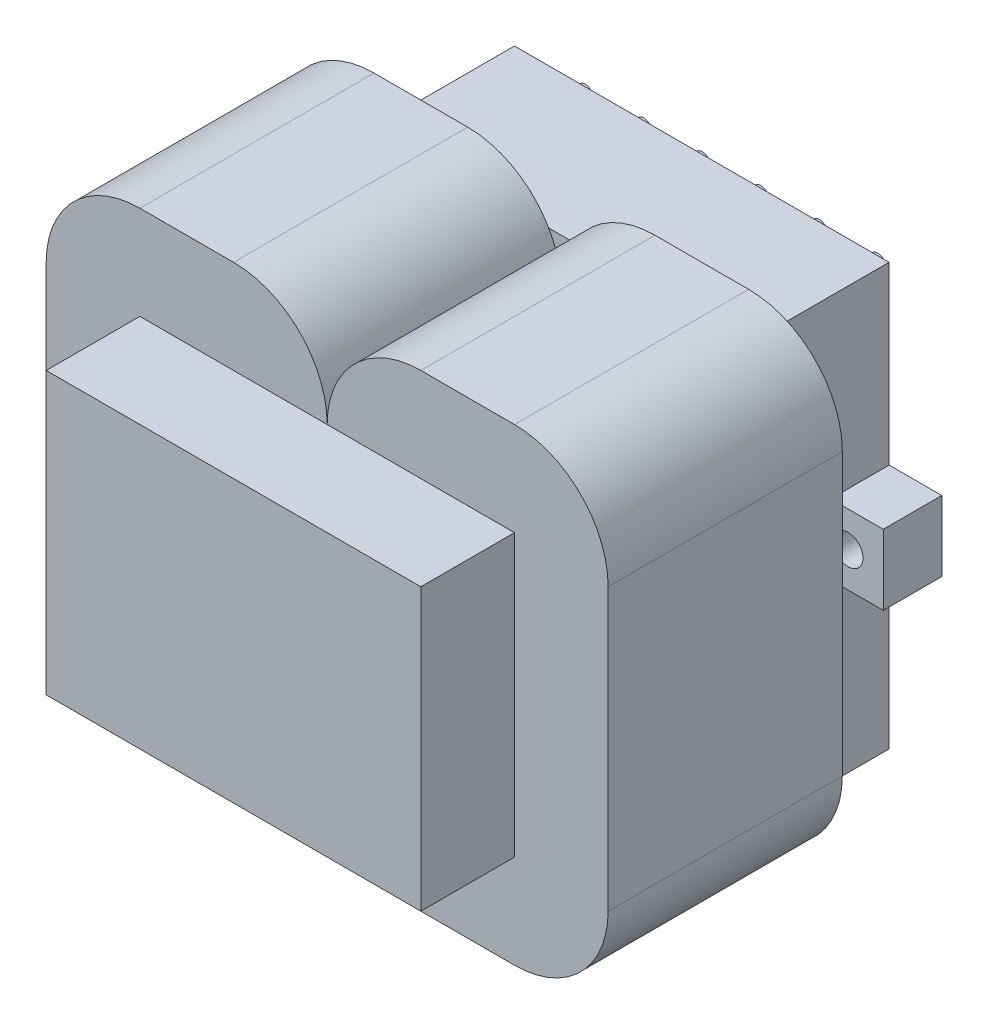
ISO-10303-21;
HEADER;
FILE_DESCRIPTION(('STEP AP214'),'2;1');
FILE_NAME('part.step','',(''),(''),'','','');
FILE_SCHEMA(('AUTOMOTIVE_DESIGN { 1 0 10303 214 1 1 1 1 }'));
ENDSEC;
DATA;
#1=APPLICATION_CONTEXT('core data for automotive mechanical design processes');
#2=APPLICATION_PROTOCOL_DEFINITION('international standard','automotive_design',2000,#1);
#3=PRODUCT_CONTEXT('',#1,'mechanical');
#4=PRODUCT('Part','Part','',(#3));
#5=PRODUCT_RELATED_PRODUCT_CATEGORY('part','',(#4));
#6=PRODUCT_DEFINITION_FORMATION('','',#4);
#7=PRODUCT_DEFINITION_CONTEXT('part definition',#1,'design');
#8=PRODUCT_DEFINITION('design','',#6,#7);
#9=PRODUCT_DEFINITION_SHAPE('','',#8);
#10=(LENGTH_UNIT() NAMED_UNIT(*) SI_UNIT(.MILLI.,.METRE.));
#11=(NAMED_UNIT(*) PLANE_ANGLE_UNIT() SI_UNIT($,.RADIAN.));
#12=(NAMED_UNIT(*) SI_UNIT($,.STERADIAN.) SOLID_ANGLE_UNIT());
#13=UNCERTAINTY_MEASURE_WITH_UNIT(LENGTH_MEASURE(1.E-05),#10,'distance_accuracy_value','');
#14=(GEOMETRIC_REPRESENTATION_CONTEXT(3) GLOBAL_UNCERTAINTY_ASSIGNED_CONTEXT((#13)) GLOBAL_UNIT_ASSIGNED_CONTEXT((#10,
#11,#12)) REPRESENTATION_CONTEXT('',''));
#15=CARTESIAN_POINT('',(0.,0.,0.));
#16=DIRECTION('',(0.,0.,1.));
#17=DIRECTION('',(1.,0.,0.));
#18=AXIS2_PLACEMENT_3D('',#15,#16,#17);
#19=CARTESIAN_POINT('',(-8.,-12.,32.));
#20=DIRECTION('',(0.,0.,-1.));
#21=DIRECTION('',(-1.,0.,0.));
#22=AXIS2_PLACEMENT_3D('',#19,#20,#21);
#23=CYLINDRICAL_SURFACE('',#22,8.);
#24=CARTESIAN_POINT('',(-8.,-12.,12.));
#25=DIRECTION('',(0.,0.,1.));
#26=DIRECTION('',(1.,0.,0.));
#27=AXIS2_PLACEMENT_3D('',#24,#25,#26);
#28=CIRCLE('',#27,8.);
#29=CARTESIAN_POINT('',(-8.,-20.,12.));
#30=VERTEX_POINT('',#29);
#31=CARTESIAN_POINT('',(0.,-12.,12.));
#32=VERTEX_POINT('',#31);
#33=EDGE_CURVE('E172',#30,#32,#28,.T.);
#34=ORIENTED_EDGE('',*,*,#33,.T.);
#35=DIRECTION('',(0.,0.,-1.));
#36=VECTOR('',#35,1.);
#37=CARTESIAN_POINT('',(0.,-12.,32.));
#38=LINE('',#37,#36);
#39=CARTESIAN_POINT('',(0.,-12.,32.));
#40=VERTEX_POINT('',#39);
#41=EDGE_CURVE('E12',#40,#32,#38,.T.);
#42=ORIENTED_EDGE('',*,*,#41,.F.);
#43=CARTESIAN_POINT('',(-8.,-12.,32.));
#44=DIRECTION('',(0.,0.,1.));
#45=DIRECTION('',(1.,0.,0.));
#46=AXIS2_PLACEMENT_3D('',#43,#44,#45);
#47=CIRCLE('',#46,8.);
#48=CARTESIAN_POINT('',(-8.,-20.,32.));
#49=VERTEX_POINT('',#48);
#50=EDGE_CURVE('E198',#49,#40,#47,.T.);
#51=ORIENTED_EDGE('',*,*,#50,.F.);
#52=DIRECTION('',(0.,0.,-1.));
#53=VECTOR('',#52,1.);
#54=CARTESIAN_POINT('',(-8.,-20.,32.));
#55=LINE('',#54,#53);
#56=EDGE_CURVE('E168',#49,#30,#55,.T.);
#57=ORIENTED_EDGE('',*,*,#56,.T.);
#58=EDGE_LOOP('',(#34,#42,#51,#57));
#59=FACE_BOUND('',#58,.T.);
#60=ADVANCED_FACE('F40',(#59),#23,.T.);
#61=CARTESIAN_POINT('',(8.,-12.,32.));
#62=DIRECTION('',(0.,0.,-1.));
#63=DIRECTION('',(-1.,0.,0.));
#64=AXIS2_PLACEMENT_3D('',#61,#62,#63);
#65=CYLINDRICAL_SURFACE('',#64,8.);
#66=CARTESIAN_POINT('',(8.,-12.,12.));
#67=DIRECTION('',(0.,0.,1.));
#68=DIRECTION('',(1.,0.,0.));
#69=AXIS2_PLACEMENT_3D('',#66,#67,#68);
#70=CIRCLE('',#69,8.);
#71=CARTESIAN_POINT('',(8.,-20.,12.));
#72=VERTEX_POINT('',#71);
#73=EDGE_CURVE('E175',#32,#72,#70,.T.);
#74=ORIENTED_EDGE('',*,*,#73,.T.);
#75=DIRECTION('',(0.,0.,-1.));
#76=VECTOR('',#75,1.);
#77=CARTESIAN_POINT('',(8.,-20.,32.));
#78=LINE('',#77,#76);
#79=CARTESIAN_POINT('',(8.,-20.,32.));
#80=VERTEX_POINT('',#79);
#81=EDGE_CURVE('E48',#80,#72,#78,.T.);
#82=ORIENTED_EDGE('',*,*,#81,.F.);
#83=CARTESIAN_POINT('',(8.,-12.,32.));
#84=DIRECTION('',(0.,0.,1.));
#85=DIRECTION('',(1.,0.,0.));
#86=AXIS2_PLACEMENT_3D('',#83,#84,#85);
#87=CIRCLE('',#86,8.);
#88=EDGE_CURVE('E117',#40,#80,#87,.T.);
#89=ORIENTED_EDGE('',*,*,#88,.F.);
#90=ORIENTED_EDGE('',*,*,#41,.T.);
#91=EDGE_LOOP('',(#74,#82,#89,#90));
#92=FACE_BOUND('',#91,.T.);
#93=ADVANCED_FACE('F286',(#92),#65,.T.);
#94=CARTESIAN_POINT('',(8.,-20.,32.));
#95=DIRECTION('',(0.,1.,0.));
#96=DIRECTION('',(0.,0.,1.));
#97=AXIS2_PLACEMENT_3D('',#94,#95,#96);
#98=PLANE('',#97);
#99=DIRECTION('',(1.,0.,0.));
#100=VECTOR('',#99,1.);
#101=CARTESIAN_POINT('',(8.,-20.,12.));
#102=LINE('',#101,#100);
#103=CARTESIAN_POINT('',(16.,-20.,12.));
#104=VERTEX_POINT('',#103);
#105=EDGE_CURVE('E177',#72,#104,#102,.T.);
#106=ORIENTED_EDGE('',*,*,#105,.T.);
#107=DIRECTION('',(0.,0.,-1.));
#108=VECTOR('',#107,1.);
#109=CARTESIAN_POINT('',(16.,-20.,32.));
#110=LINE('',#109,#108);
#111=CARTESIAN_POINT('',(16.,-20.,32.));
#112=VERTEX_POINT('',#111);
#113=EDGE_CURVE('E223',#112,#104,#110,.T.);
#114=ORIENTED_EDGE('',*,*,#113,.F.);
#115=DIRECTION('',(1.,0.,0.));
#116=VECTOR('',#115,1.);
#117=CARTESIAN_POINT('',(8.,-20.,32.));
#118=LINE('',#117,#116);
#119=EDGE_CURVE('E231',#80,#112,#118,.T.);
#120=ORIENTED_EDGE('',*,*,#119,.F.);
#121=ORIENTED_EDGE('',*,*,#81,.T.);
#122=EDGE_LOOP('',(#106,#114,#120,#121));
#123=FACE_BOUND('',#122,.T.);
#124=ADVANCED_FACE('F229',(#123),#98,.F.);
#125=CARTESIAN_POINT('',(16.,-12.,32.));
#126=DIRECTION('',(0.,0.,-1.));
#127=DIRECTION('',(-1.,0.,0.));
#128=AXIS2_PLACEMENT_3D('',#125,#126,#127);
#129=CYLINDRICAL_SURFACE('',#128,8.);
#130=CARTESIAN_POINT('',(16.,-12.,12.));
#131=DIRECTION('',(0.,0.,1.));
#132=DIRECTION('',(1.,0.,0.));
#133=AXIS2_PLACEMENT_3D('',#130,#131,#132);
#134=CIRCLE('',#133,8.);
#135=CARTESIAN_POINT('',(24.,-12.,12.));
#136=VERTEX_POINT('',#135);
#137=EDGE_CURVE('E179',#104,#136,#134,.T.);
#138=ORIENTED_EDGE('',*,*,#137,.T.);
#139=DIRECTION('',(0.,0.,-1.));
#140=VECTOR('',#139,1.);
#141=CARTESIAN_POINT('',(24.,-12.,32.));
#142=LINE('',#141,#140);
#143=CARTESIAN_POINT('',(24.,-12.,32.));
#144=VERTEX_POINT('',#143);
#145=EDGE_CURVE('E220',#144,#136,#142,.T.);
#146=ORIENTED_EDGE('',*,*,#145,.F.);
#147=CARTESIAN_POINT('',(16.,-12.,32.));
#148=DIRECTION('',(0.,0.,1.));
#149=DIRECTION('',(1.,0.,0.));
#150=AXIS2_PLACEMENT_3D('',#147,#148,#149);
#151=CIRCLE('',#150,8.);
#152=EDGE_CURVE('E249',#112,#144,#151,.T.);
#153=ORIENTED_EDGE('',*,*,#152,.F.);
#154=ORIENTED_EDGE('',*,*,#113,.T.);
#155=EDGE_LOOP('',(#138,#146,#153,#154));
#156=FACE_BOUND('',#155,.T.);
#157=ADVANCED_FACE('F240',(#156),#129,.T.);
#158=CARTESIAN_POINT('',(24.,12.,32.));
#159=DIRECTION('',(-1.,0.,0.));
#160=DIRECTION('',(0.,-1.,0.));
#161=AXIS2_PLACEMENT_3D('',#158,#159,#160);
#162=PLANE('',#161);
#163=DIRECTION('',(0.,1.,0.));
#164=VECTOR('',#163,1.);
#165=CARTESIAN_POINT('',(24.,12.,12.));
#166=LINE('',#165,#164);
#167=CARTESIAN_POINT('',(24.,12.,12.));
#168=VERTEX_POINT('',#167);
#169=EDGE_CURVE('E181',#136,#168,#166,.T.);
#170=ORIENTED_EDGE('',*,*,#169,.T.);
#171=DIRECTION('',(0.,0.,-1.));
#172=VECTOR('',#171,1.);
#173=CARTESIAN_POINT('',(24.,12.,32.));
#174=LINE('',#173,#172);
#175=CARTESIAN_POINT('',(24.,12.,32.));
#176=VERTEX_POINT('',#175);
#177=EDGE_CURVE('E217',#176,#168,#174,.T.);
#178=ORIENTED_EDGE('',*,*,#177,.F.);
#179=DIRECTION('',(0.,1.,0.));
#180=VECTOR('',#179,1.);
#181=CARTESIAN_POINT('',(24.,12.,32.));
#182=LINE('',#181,#180);
#183=EDGE_CURVE('E246',#144,#176,#182,.T.);
#184=ORIENTED_EDGE('',*,*,#183,.F.);
#185=ORIENTED_EDGE('',*,*,#145,.T.);
#186=EDGE_LOOP('',(#170,#178,#184,#185));
#187=FACE_BOUND('',#186,.T.);
#188=ADVANCED_FACE('F244',(#187),#162,.F.);
#189=CARTESIAN_POINT('',(16.,12.,32.));
#190=DIRECTION('',(0.,0.,-1.));
#191=DIRECTION('',(-1.,0.,0.));
#192=AXIS2_PLACEMENT_3D('',#189,#190,#191);
#193=CYLINDRICAL_SURFACE('',#192,8.);
#194=CARTESIAN_POINT('',(16.,12.,12.));
#195=DIRECTION('',(0.,0.,1.));
#196=DIRECTION('',(1.,0.,0.));
#197=AXIS2_PLACEMENT_3D('',#194,#195,#196);
#198=CIRCLE('',#197,8.);
#199=CARTESIAN_POINT('',(16.,20.,12.));
#200=VERTEX_POINT('',#199);
#201=EDGE_CURVE('E183',#168,#200,#198,.T.);
#202=ORIENTED_EDGE('',*,*,#201,.T.);
#203=DIRECTION('',(0.,0.,-1.));
#204=VECTOR('',#203,1.);
#205=CARTESIAN_POINT('',(16.,20.,32.));
#206=LINE('',#205,#204);
#207=CARTESIAN_POINT('',(16.,20.,32.));
#208=VERTEX_POINT('',#207);
#209=EDGE_CURVE('E214',#208,#200,#206,.T.);
#210=ORIENTED_EDGE('',*,*,#209,.F.);
#211=CARTESIAN_POINT('',(16.,12.,32.));
#212=DIRECTION('',(0.,0.,1.));
#213=DIRECTION('',(1.,0.,0.));
#214=AXIS2_PLACEMENT_3D('',#211,#212,#213);
#215=CIRCLE('',#214,8.);
#216=EDGE_CURVE('E248',#176,#208,#215,.T.);
#217=ORIENTED_EDGE('',*,*,#216,.F.);
#218=ORIENTED_EDGE('',*,*,#177,.T.);
#219=EDGE_LOOP('',(#202,#210,#217,#218));
#220=FACE_BOUND('',#219,.T.);
#221=ADVANCED_FACE('F299',(#220),#193,.T.);
#222=CARTESIAN_POINT('',(8.,20.,32.));
#223=DIRECTION('',(0.,-1.,0.));
#224=DIRECTION('',(0.,0.,-1.));
#225=AXIS2_PLACEMENT_3D('',#222,#223,#224);
#226=PLANE('',#225);
#227=DIRECTION('',(-1.,0.,0.));
#228=VECTOR('',#227,1.);
#229=CARTESIAN_POINT('',(8.,20.,12.));
#230=LINE('',#229,#228);
#231=CARTESIAN_POINT('',(8.,20.,12.));
#232=VERTEX_POINT('',#231);
#233=EDGE_CURVE('E185',#200,#232,#230,.T.);
#234=ORIENTED_EDGE('',*,*,#233,.T.);
#235=DIRECTION('',(0.,0.,-1.));
#236=VECTOR('',#235,1.);
#237=CARTESIAN_POINT('',(8.,20.,32.));
#238=LINE('',#237,#236);
#239=CARTESIAN_POINT('',(8.,20.,32.));
#240=VERTEX_POINT('',#239);
#241=EDGE_CURVE('E211',#240,#232,#238,.T.);
#242=ORIENTED_EDGE('',*,*,#241,.F.);
#243=DIRECTION('',(-1.,0.,0.));
#244=VECTOR('',#243,1.);
#245=CARTESIAN_POINT('',(8.,20.,32.));
#246=LINE('',#245,#244);
#247=EDGE_CURVE('E251',#208,#240,#246,.T.);
#248=ORIENTED_EDGE('',*,*,#247,.F.);
#249=ORIENTED_EDGE('',*,*,#209,.T.);
#250=EDGE_LOOP('',(#234,#242,#248,#249));
#251=FACE_BOUND('',#250,.T.);
#252=ADVANCED_FACE('F302',(#251),#226,.F.);
#253=CARTESIAN_POINT('',(8.,12.,32.));
#254=DIRECTION('',(0.,0.,-1.));
#255=DIRECTION('',(-1.,0.,0.));
#256=AXIS2_PLACEMENT_3D('',#253,#254,#255);
#257=CYLINDRICAL_SURFACE('',#256,8.);
#258=CARTESIAN_POINT('',(8.,12.,12.));
#259=DIRECTION('',(0.,0.,1.));
#260=DIRECTION('',(-1.,0.,0.));
#261=AXIS2_PLACEMENT_3D('',#258,#259,#260);
#262=CIRCLE('',#261,8.);
#263=CARTESIAN_POINT('',(0.,12.,12.));
#264=VERTEX_POINT('',#263);
#265=EDGE_CURVE('E187',#232,#264,#262,.T.);
#266=ORIENTED_EDGE('',*,*,#265,.T.);
#267=DIRECTION('',(0.,0.,-1.));
#268=VECTOR('',#267,1.);
#269=CARTESIAN_POINT('',(0.,12.,32.));
#270=LINE('',#269,#268);
#271=CARTESIAN_POINT('',(0.,12.,32.));
#272=VERTEX_POINT('',#271);
#273=EDGE_CURVE('E208',#272,#264,#270,.T.);
#274=ORIENTED_EDGE('',*,*,#273,.F.);
#275=CARTESIAN_POINT('',(8.,12.,32.));
#276=DIRECTION('',(0.,0.,1.));
#277=DIRECTION('',(-1.,0.,0.));
#278=AXIS2_PLACEMENT_3D('',#275,#276,#277);
#279=CIRCLE('',#278,8.);
#280=EDGE_CURVE('E257',#240,#272,#279,.T.);
#281=ORIENTED_EDGE('',*,*,#280,.F.);
#282=ORIENTED_EDGE('',*,*,#241,.T.);
#283=EDGE_LOOP('',(#266,#274,#281,#282));
#284=FACE_BOUND('',#283,.T.);
#285=ADVANCED_FACE('F306',(#284),#257,.T.);
#286=CARTESIAN_POINT('',(-8.,12.,32.));
#287=DIRECTION('',(0.,0.,-1.));
#288=DIRECTION('',(-1.,0.,0.));
#289=AXIS2_PLACEMENT_3D('',#286,#287,#288);
#290=CYLINDRICAL_SURFACE('',#289,8.);
#291=CARTESIAN_POINT('',(-8.,12.,12.));
#292=DIRECTION('',(0.,0.,1.));
#293=DIRECTION('',(-1.,0.,0.));
#294=AXIS2_PLACEMENT_3D('',#291,#292,#293);
#295=CIRCLE('',#294,8.);
#296=CARTESIAN_POINT('',(-8.,20.,12.));
#297=VERTEX_POINT('',#296);
#298=EDGE_CURVE('E189',#264,#297,#295,.T.);
#299=ORIENTED_EDGE('',*,*,#298,.T.);
#300=DIRECTION('',(0.,0.,-1.));
#301=VECTOR('',#300,1.);
#302=CARTESIAN_POINT('',(-8.,20.,32.));
#303=LINE('',#302,#301);
#304=CARTESIAN_POINT('',(-8.,20.,32.));
#305=VERTEX_POINT('',#304);
#306=EDGE_CURVE('E205',#305,#297,#303,.T.);
#307=ORIENTED_EDGE('',*,*,#306,.F.);
#308=CARTESIAN_POINT('',(-8.,12.,32.));
#309=DIRECTION('',(0.,0.,1.));
#310=DIRECTION('',(-1.,0.,0.));
#311=AXIS2_PLACEMENT_3D('',#308,#309,#310);
#312=CIRCLE('',#311,8.);
#313=EDGE_CURVE('E259',#272,#305,#312,.T.);
#314=ORIENTED_EDGE('',*,*,#313,.F.);
#315=ORIENTED_EDGE('',*,*,#273,.T.);
#316=EDGE_LOOP('',(#299,#307,#314,#315));
#317=FACE_BOUND('',#316,.T.);
#318=ADVANCED_FACE('F310',(#317),#290,.T.);
#319=CARTESIAN_POINT('',(-8.,20.,32.));
#320=DIRECTION('',(0.,-1.,0.));
#321=DIRECTION('',(0.,0.,-1.));
#322=AXIS2_PLACEMENT_3D('',#319,#320,#321);
#323=PLANE('',#322);
#324=DIRECTION('',(-1.,0.,0.));
#325=VECTOR('',#324,1.);
#326=CARTESIAN_POINT('',(-8.,20.,12.));
#327=LINE('',#326,#325);
#328=CARTESIAN_POINT('',(-16.,20.,12.));
#329=VERTEX_POINT('',#328);
#330=EDGE_CURVE('E191',#297,#329,#327,.T.);
#331=ORIENTED_EDGE('',*,*,#330,.T.);
#332=DIRECTION('',(0.,0.,-1.));
#333=VECTOR('',#332,1.);
#334=CARTESIAN_POINT('',(-16.,20.,32.));
#335=LINE('',#334,#333);
#336=CARTESIAN_POINT('',(-16.,20.,32.));
#337=VERTEX_POINT('',#336);
#338=EDGE_CURVE('E202',#337,#329,#335,.T.);
#339=ORIENTED_EDGE('',*,*,#338,.F.);
#340=DIRECTION('',(-1.,0.,0.));
#341=VECTOR('',#340,1.);
#342=CARTESIAN_POINT('',(-8.,20.,32.));
#343=LINE('',#342,#341);
#344=EDGE_CURVE('E261',#305,#337,#343,.T.);
#345=ORIENTED_EDGE('',*,*,#344,.F.);
#346=ORIENTED_EDGE('',*,*,#306,.T.);
#347=EDGE_LOOP('',(#331,#339,#345,#346));
#348=FACE_BOUND('',#347,.T.);
#349=ADVANCED_FACE('F267',(#348),#323,.F.);
#350=CARTESIAN_POINT('',(-16.,12.,32.));
#351=DIRECTION('',(0.,0.,-1.));
#352=DIRECTION('',(-1.,0.,0.));
#353=AXIS2_PLACEMENT_3D('',#350,#351,#352);
#354=CYLINDRICAL_SURFACE('',#353,8.);
#355=CARTESIAN_POINT('',(-16.,12.,12.));
#356=DIRECTION('',(0.,0.,1.));
#357=DIRECTION('',(-1.,0.,0.));
#358=AXIS2_PLACEMENT_3D('',#355,#356,#357);
#359=CIRCLE('',#358,8.);
#360=CARTESIAN_POINT('',(-24.,12.,12.));
#361=VERTEX_POINT('',#360);
#362=EDGE_CURVE('E193',#329,#361,#359,.T.);
#363=ORIENTED_EDGE('',*,*,#362,.T.);
#364=DIRECTION('',(0.,0.,-1.));
#365=VECTOR('',#364,1.);
#366=CARTESIAN_POINT('',(-24.,12.,32.));
#367=LINE('',#366,#365);
#368=CARTESIAN_POINT('',(-24.,12.,32.));
#369=VERTEX_POINT('',#368);
#370=EDGE_CURVE('E163',#369,#361,#367,.T.);
#371=ORIENTED_EDGE('',*,*,#370,.F.);
#372=CARTESIAN_POINT('',(-16.,12.,32.));
#373=DIRECTION('',(0.,0.,1.));
#374=DIRECTION('',(-1.,0.,0.));
#375=AXIS2_PLACEMENT_3D('',#372,#373,#374);
#376=CIRCLE('',#375,8.);
#377=EDGE_CURVE('E154',#337,#369,#376,.T.);
#378=ORIENTED_EDGE('',*,*,#377,.F.);
#379=ORIENTED_EDGE('',*,*,#338,.T.);
#380=EDGE_LOOP('',(#363,#371,#378,#379));
#381=FACE_BOUND('',#380,.T.);
#382=ADVANCED_FACE('F271',(#381),#354,.T.);
#383=CARTESIAN_POINT('',(-24.,-12.,32.));
#384=DIRECTION('',(1.,0.,0.));
#385=DIRECTION('',(0.,0.,-1.));
#386=AXIS2_PLACEMENT_3D('',#383,#384,#385);
#387=PLANE('',#386);
#388=DIRECTION('',(0.,-1.,0.));
#389=VECTOR('',#388,1.);
#390=CARTESIAN_POINT('',(-24.,-12.,12.));
#391=LINE('',#390,#389);
#392=CARTESIAN_POINT('',(-24.,-12.,12.));
#393=VERTEX_POINT('',#392);
#394=EDGE_CURVE('E162',#361,#393,#391,.T.);
#395=ORIENTED_EDGE('',*,*,#394,.T.);
#396=DIRECTION('',(0.,0.,-1.));
#397=VECTOR('',#396,1.);
#398=CARTESIAN_POINT('',(-24.,-12.,32.));
#399=LINE('',#398,#397);
#400=CARTESIAN_POINT('',(-24.,-12.,32.));
#401=VERTEX_POINT('',#400);
#402=EDGE_CURVE('E159',#401,#393,#399,.T.);
#403=ORIENTED_EDGE('',*,*,#402,.F.);
#404=DIRECTION('',(0.,-1.,0.));
#405=VECTOR('',#404,1.);
#406=CARTESIAN_POINT('',(-24.,-12.,32.));
#407=LINE('',#406,#405);
#408=EDGE_CURVE('E148',#369,#401,#407,.T.);
#409=ORIENTED_EDGE('',*,*,#408,.F.);
#410=ORIENTED_EDGE('',*,*,#370,.T.);
#411=EDGE_LOOP('',(#395,#403,#409,#410));
#412=FACE_BOUND('',#411,.T.);
#413=ADVANCED_FACE('F160',(#412),#387,.F.);
#414=CARTESIAN_POINT('',(-16.,-12.,32.));
#415=DIRECTION('',(0.,0.,-1.));
#416=DIRECTION('',(-1.,0.,0.));
#417=AXIS2_PLACEMENT_3D('',#414,#415,#416);
#418=CYLINDRICAL_SURFACE('',#417,8.);
#419=CARTESIAN_POINT('',(-16.,-12.,12.));
#420=DIRECTION('',(0.,0.,1.));
#421=DIRECTION('',(1.,0.,0.));
#422=AXIS2_PLACEMENT_3D('',#419,#420,#421);
#423=CIRCLE('',#422,8.);
#424=CARTESIAN_POINT('',(-16.,-20.,12.));
#425=VERTEX_POINT('',#424);
#426=EDGE_CURVE('E103',#393,#425,#423,.T.);
#427=ORIENTED_EDGE('',*,*,#426,.T.);
#428=DIRECTION('',(0.,0.,-1.));
#429=VECTOR('',#428,1.);
#430=CARTESIAN_POINT('',(-16.,-20.,32.));
#431=LINE('',#430,#429);
#432=CARTESIAN_POINT('',(-16.,-20.,32.));
#433=VERTEX_POINT('',#432);
#434=EDGE_CURVE('E164',#433,#425,#431,.T.);
#435=ORIENTED_EDGE('',*,*,#434,.F.);
#436=CARTESIAN_POINT('',(-16.,-12.,32.));
#437=DIRECTION('',(0.,0.,1.));
#438=DIRECTION('',(1.,0.,0.));
#439=AXIS2_PLACEMENT_3D('',#436,#437,#438);
#440=CIRCLE('',#439,8.);
#441=EDGE_CURVE('E152',#401,#433,#440,.T.);
#442=ORIENTED_EDGE('',*,*,#441,.F.);
#443=ORIENTED_EDGE('',*,*,#402,.T.);
#444=EDGE_LOOP('',(#427,#435,#442,#443));
#445=FACE_BOUND('',#444,.T.);
#446=ADVANCED_FACE('F166',(#445),#418,.T.);
#447=CARTESIAN_POINT('',(-16.,-20.,32.));
#448=DIRECTION('',(0.,1.,0.));
#449=DIRECTION('',(0.,0.,1.));
#450=AXIS2_PLACEMENT_3D('',#447,#448,#449);
#451=PLANE('',#450);
#452=DIRECTION('',(1.,0.,0.));
#453=VECTOR('',#452,1.);
#454=CARTESIAN_POINT('',(-16.,-20.,12.));
#455=LINE('',#454,#453);
#456=EDGE_CURVE('E109',#425,#30,#455,.T.);
#457=ORIENTED_EDGE('',*,*,#456,.T.);
#458=ORIENTED_EDGE('',*,*,#56,.F.);
#459=DIRECTION('',(1.,0.,0.));
#460=VECTOR('',#459,1.);
#461=CARTESIAN_POINT('',(-16.,-20.,32.));
#462=LINE('',#461,#460);
#463=EDGE_CURVE('E56',#433,#49,#462,.T.);
#464=ORIENTED_EDGE('',*,*,#463,.F.);
#465=ORIENTED_EDGE('',*,*,#434,.T.);
#466=EDGE_LOOP('',(#457,#458,#464,#465));
#467=FACE_BOUND('',#466,.T.);
#468=ADVANCED_FACE('F275',(#467),#451,.F.);
#469=CARTESIAN_POINT('',(-8.,-12.,32.));
#470=DIRECTION('',(0.,0.,1.));
#471=DIRECTION('',(1.,0.,0.));
#472=AXIS2_PLACEMENT_3D('',#469,#470,#471);
#473=PLANE('',#472);
#474=ORIENTED_EDGE('',*,*,#50,.T.);
#475=ORIENTED_EDGE('',*,*,#88,.T.);
#476=ORIENTED_EDGE('',*,*,#119,.T.);
#477=ORIENTED_EDGE('',*,*,#152,.T.);
#478=ORIENTED_EDGE('',*,*,#183,.T.);
#479=ORIENTED_EDGE('',*,*,#216,.T.);
#480=ORIENTED_EDGE('',*,*,#247,.T.);
#481=ORIENTED_EDGE('',*,*,#280,.T.);
#482=ORIENTED_EDGE('',*,*,#313,.T.);
#483=ORIENTED_EDGE('',*,*,#344,.T.);
#484=ORIENTED_EDGE('',*,*,#377,.T.);
#485=ORIENTED_EDGE('',*,*,#408,.T.);
#486=ORIENTED_EDGE('',*,*,#441,.T.);
#487=ORIENTED_EDGE('',*,*,#463,.T.);
#488=EDGE_LOOP('',(#474,#475,#476,#477,#478,#479,#480,#481,#482,#483,#484,#485,#486,#487));
#489=FACE_BOUND('',#488,.T.);
#490=ADVANCED_FACE('F150',(#489),#473,.T.);
#491=CARTESIAN_POINT('',(-8.,-12.,12.));
#492=DIRECTION('',(0.,0.,1.));
#493=DIRECTION('',(1.,0.,0.));
#494=AXIS2_PLACEMENT_3D('',#491,#492,#493);
#495=PLANE('',#494);
#496=ORIENTED_EDGE('',*,*,#33,.F.);
#497=ORIENTED_EDGE('',*,*,#456,.F.);
#498=ORIENTED_EDGE('',*,*,#426,.F.);
#499=ORIENTED_EDGE('',*,*,#394,.F.);
#500=ORIENTED_EDGE('',*,*,#362,.F.);
#501=ORIENTED_EDGE('',*,*,#330,.F.);
#502=ORIENTED_EDGE('',*,*,#298,.F.);
#503=ORIENTED_EDGE('',*,*,#265,.F.);
#504=ORIENTED_EDGE('',*,*,#233,.F.);
#505=ORIENTED_EDGE('',*,*,#201,.F.);
#506=ORIENTED_EDGE('',*,*,#169,.F.);
#507=ORIENTED_EDGE('',*,*,#137,.F.);
#508=ORIENTED_EDGE('',*,*,#105,.F.);
#509=ORIENTED_EDGE('',*,*,#73,.F.);
#510=EDGE_LOOP('',(#496,#497,#498,#499,#500,#501,#502,#503,#504,#505,#506,#507,#508,#509));
#511=FACE_BOUND('',#510,.T.);
#512=ADVANCED_FACE('F235',(#511),#495,.F.);
#513=CLOSED_SHELL('',(#60,#93,#124,#157,#188,#221,#252,#285,#318,#349,#382,#413,#446,#468,#490,#512));
#514=MANIFOLD_SOLID_BREP('B2',#513);
#515=CARTESIAN_POINT('',(-12.49934,12.99972,-2.54));
#516=DIRECTION('',(0.,0.,1.));
#517=DIRECTION('',(1.,0.,0.));
#518=AXIS2_PLACEMENT_3D('',#515,#516,#517);
#519=CYLINDRICAL_SURFACE('',#518,0.6604);
#520=CARTESIAN_POINT('',(-12.49934,12.99972,-2.54));
#521=DIRECTION('',(0.,0.,-1.));
#522=DIRECTION('',(-1.,0.,0.));
#523=AXIS2_PLACEMENT_3D('',#520,#521,#522);
#524=CIRCLE('',#523,0.6604);
#525=CARTESIAN_POINT('',(-13.15974,12.99972,-2.54));
#526=VERTEX_POINT('',#525);
#527=EDGE_CURVE('E39',#526,#526,#524,.T.);
#528=ORIENTED_EDGE('',*,*,#527,.F.);
#529=EDGE_LOOP('',(#528));
#530=FACE_BOUND('',#529,.T.);
#531=CARTESIAN_POINT('',(-12.49934,12.99972,0.));
#532=DIRECTION('',(0.,0.,-1.));
#533=DIRECTION('',(-1.,0.,0.));
#534=AXIS2_PLACEMENT_3D('',#531,#532,#533);
#535=CIRCLE('',#534,0.6604);
#536=CARTESIAN_POINT('',(-13.15974,12.99972,0.));
#537=VERTEX_POINT('',#536);
#538=EDGE_CURVE('E434',#537,#537,#535,.T.);
#539=ORIENTED_EDGE('',*,*,#538,.T.);
#540=EDGE_LOOP('',(#539));
#541=FACE_BOUND('',#540,.T.);
#542=ADVANCED_FACE('F431',(#530,#541),#519,.T.);
#543=CARTESIAN_POINT('',(-12.49934,12.99972,-2.54));
#544=DIRECTION('',(0.,0.,-1.));
#545=DIRECTION('',(-1.,0.,0.));
#546=AXIS2_PLACEMENT_3D('',#543,#544,#545);
#547=PLANE('',#546);
#548=ORIENTED_EDGE('',*,*,#527,.T.);
#549=EDGE_LOOP('',(#548));
#550=FACE_BOUND('',#549,.T.);
#551=ADVANCED_FACE('F446',(#550),#547,.T.);
#552=CARTESIAN_POINT('',(-12.49934,12.99972,0.));
#553=DIRECTION('',(0.,0.,-1.));
#554=DIRECTION('',(-1.,0.,0.));
#555=AXIS2_PLACEMENT_3D('',#552,#553,#554);
#556=PLANE('',#555);
#557=ORIENTED_EDGE('',*,*,#538,.F.);
#558=EDGE_LOOP('',(#557));
#559=FACE_BOUND('',#558,.T.);
#560=ADVANCED_FACE('F444',(#559),#556,.F.);
#561=CLOSED_SHELL('',(#542,#551,#560));
#562=MANIFOLD_SOLID_BREP('B6',#561);
#563=CARTESIAN_POINT('',(-7.50062,12.99972,-2.54));
#564=DIRECTION('',(0.,0.,1.));
#565=DIRECTION('',(1.,0.,0.));
#566=AXIS2_PLACEMENT_3D('',#563,#564,#565);
#567=CYLINDRICAL_SURFACE('',#566,0.660399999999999);
#568=CARTESIAN_POINT('',(-7.50062,12.99972,-2.54));
#569=DIRECTION('',(0.,0.,-1.));
#570=DIRECTION('',(-1.,0.,0.));
#571=AXIS2_PLACEMENT_3D('',#568,#569,#570);
#572=CIRCLE('',#571,0.660399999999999);
#573=CARTESIAN_POINT('',(-8.16102,12.99972,-2.54));
#574=VERTEX_POINT('',#573);
#575=EDGE_CURVE('E430',#574,#574,#572,.T.);
#576=ORIENTED_EDGE('',*,*,#575,.F.);
#577=EDGE_LOOP('',(#576));
#578=FACE_BOUND('',#577,.T.);
#579=CARTESIAN_POINT('',(-7.50062,12.99972,0.));
#580=DIRECTION('',(0.,0.,-1.));
#581=DIRECTION('',(-1.,0.,0.));
#582=AXIS2_PLACEMENT_3D('',#579,#580,#581);
#583=CIRCLE('',#582,0.660399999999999);
#584=CARTESIAN_POINT('',(-8.16102,12.99972,0.));
#585=VERTEX_POINT('',#584);
#586=EDGE_CURVE('E482',#585,#585,#583,.T.);
#587=ORIENTED_EDGE('',*,*,#586,.T.);
#588=EDGE_LOOP('',(#587));
#589=FACE_BOUND('',#588,.T.);
#590=ADVANCED_FACE('F479',(#578,#589),#567,.T.);
#591=CARTESIAN_POINT('',(-7.50062,12.99972,-2.54));
#592=DIRECTION('',(0.,0.,-1.));
#593=DIRECTION('',(-1.,0.,0.));
#594=AXIS2_PLACEMENT_3D('',#591,#592,#593);
#595=PLANE('',#594);
#596=ORIENTED_EDGE('',*,*,#575,.T.);
#597=EDGE_LOOP('',(#596));
#598=FACE_BOUND('',#597,.T.);
#599=ADVANCED_FACE('F494',(#598),#595,.T.);
#600=CARTESIAN_POINT('',(-7.50062,12.99972,0.));
#601=DIRECTION('',(0.,0.,-1.));
#602=DIRECTION('',(-1.,0.,0.));
#603=AXIS2_PLACEMENT_3D('',#600,#601,#602);
#604=PLANE('',#603);
#605=ORIENTED_EDGE('',*,*,#586,.F.);
#606=EDGE_LOOP('',(#605));
#607=FACE_BOUND('',#606,.T.);
#608=ADVANCED_FACE('F492',(#607),#604,.F.);
#609=CLOSED_SHELL('',(#590,#599,#608));
#610=MANIFOLD_SOLID_BREP('B34',#609);
#611=CARTESIAN_POINT('',(-2.49936,12.99972,-2.54));
#612=DIRECTION('',(0.,0.,1.));
#613=DIRECTION('',(1.,0.,0.));
#614=AXIS2_PLACEMENT_3D('',#611,#612,#613);
#615=CYLINDRICAL_SURFACE('',#614,0.6604);
#616=CARTESIAN_POINT('',(-2.49936,12.99972,-2.54));
#617=DIRECTION('',(0.,0.,-1.));
#618=DIRECTION('',(-1.,0.,0.));
#619=AXIS2_PLACEMENT_3D('',#616,#617,#618);
#620=CIRCLE('',#619,0.6604);
#621=CARTESIAN_POINT('',(-3.15976,12.99972,-2.54));
#622=VERTEX_POINT('',#621);
#623=EDGE_CURVE('E478',#622,#622,#620,.T.);
#624=ORIENTED_EDGE('',*,*,#623,.F.);
#625=EDGE_LOOP('',(#624));
#626=FACE_BOUND('',#625,.T.);
#627=CARTESIAN_POINT('',(-2.49936,12.99972,0.));
#628=DIRECTION('',(0.,0.,-1.));
#629=DIRECTION('',(-1.,0.,0.));
#630=AXIS2_PLACEMENT_3D('',#627,#628,#629);
#631=CIRCLE('',#630,0.6604);
#632=CARTESIAN_POINT('',(-3.15976,12.99972,0.));
#633=VERTEX_POINT('',#632);
#634=EDGE_CURVE('E530',#633,#633,#631,.T.);
#635=ORIENTED_EDGE('',*,*,#634,.T.);
#636=EDGE_LOOP('',(#635));
#637=FACE_BOUND('',#636,.T.);
#638=ADVANCED_FACE('F527',(#626,#637),#615,.T.);
#639=CARTESIAN_POINT('',(-2.49936,12.99972,-2.54));
#640=DIRECTION('',(0.,0.,-1.));
#641=DIRECTION('',(-1.,0.,0.));
#642=AXIS2_PLACEMENT_3D('',#639,#640,#641);
#643=PLANE('',#642);
#644=ORIENTED_EDGE('',*,*,#623,.T.);
#645=EDGE_LOOP('',(#644));
#646=FACE_BOUND('',#645,.T.);
#647=ADVANCED_FACE('F542',(#646),#643,.T.);
#648=CARTESIAN_POINT('',(-2.49936,12.99972,0.));
#649=DIRECTION('',(0.,0.,-1.));
#650=DIRECTION('',(-1.,0.,0.));
#651=AXIS2_PLACEMENT_3D('',#648,#649,#650);
#652=PLANE('',#651);
#653=ORIENTED_EDGE('',*,*,#634,.F.);
#654=EDGE_LOOP('',(#653));
#655=FACE_BOUND('',#654,.T.);
#656=ADVANCED_FACE('F540',(#655),#652,.F.);
#657=CLOSED_SHELL('',(#638,#647,#656));
#658=MANIFOLD_SOLID_BREP('B425',#657);
#659=CARTESIAN_POINT('',(2.49936,12.99972,-2.54));
#660=DIRECTION('',(0.,0.,1.));
#661=DIRECTION('',(1.,0.,0.));
#662=AXIS2_PLACEMENT_3D('',#659,#660,#661);
#663=CYLINDRICAL_SURFACE('',#662,0.6604);
#664=CARTESIAN_POINT('',(2.49936,12.99972,-2.54));
#665=DIRECTION('',(0.,0.,-1.));
#666=DIRECTION('',(-1.,0.,0.));
#667=AXIS2_PLACEMENT_3D('',#664,#665,#666);
#668=CIRCLE('',#667,0.6604);
#669=CARTESIAN_POINT('',(1.83896,12.99972,-2.54));
#670=VERTEX_POINT('',#669);
#671=EDGE_CURVE('E526',#670,#670,#668,.T.);
#672=ORIENTED_EDGE('',*,*,#671,.F.);
#673=EDGE_LOOP('',(#672));
#674=FACE_BOUND('',#673,.T.);
#675=CARTESIAN_POINT('',(2.49936,12.99972,0.));
#676=DIRECTION('',(0.,0.,-1.));
#677=DIRECTION('',(-1.,0.,0.));
#678=AXIS2_PLACEMENT_3D('',#675,#676,#677);
#679=CIRCLE('',#678,0.6604);
#680=CARTESIAN_POINT('',(1.83896,12.99972,0.));
#681=VERTEX_POINT('',#680);
#682=EDGE_CURVE('E578',#681,#681,#679,.T.);
#683=ORIENTED_EDGE('',*,*,#682,.T.);
#684=EDGE_LOOP('',(#683));
#685=FACE_BOUND('',#684,.T.);
#686=ADVANCED_FACE('F575',(#674,#685),#663,.T.);
#687=CARTESIAN_POINT('',(2.49936,12.99972,-2.54));
#688=DIRECTION('',(0.,0.,-1.));
#689=DIRECTION('',(-1.,0.,0.));
#690=AXIS2_PLACEMENT_3D('',#687,#688,#689);
#691=PLANE('',#690);
#692=ORIENTED_EDGE('',*,*,#671,.T.);
#693=EDGE_LOOP('',(#692));
#694=FACE_BOUND('',#693,.T.);
#695=ADVANCED_FACE('F590',(#694),#691,.T.);
#696=CARTESIAN_POINT('',(2.49936,12.99972,0.));
#697=DIRECTION('',(0.,0.,-1.));
#698=DIRECTION('',(-1.,0.,0.));
#699=AXIS2_PLACEMENT_3D('',#696,#697,#698);
#700=PLANE('',#699);
#701=ORIENTED_EDGE('',*,*,#682,.F.);
#702=EDGE_LOOP('',(#701));
#703=FACE_BOUND('',#702,.T.);
#704=ADVANCED_FACE('F588',(#703),#700,.F.);
#705=CLOSED_SHELL('',(#686,#695,#704));
#706=MANIFOLD_SOLID_BREP('B473',#705);
#707=CARTESIAN_POINT('',(7.50062,12.99972,-2.54));
#708=DIRECTION('',(0.,0.,1.));
#709=DIRECTION('',(1.,0.,0.));
#710=AXIS2_PLACEMENT_3D('',#707,#708,#709);
#711=CYLINDRICAL_SURFACE('',#710,0.6604);
#712=CARTESIAN_POINT('',(7.50062,12.99972,-2.54));
#713=DIRECTION('',(0.,0.,-1.));
#714=DIRECTION('',(-1.,0.,0.));
#715=AXIS2_PLACEMENT_3D('',#712,#713,#714);
#716=CIRCLE('',#715,0.6604);
#717=CARTESIAN_POINT('',(6.84022,12.99972,-2.54));
#718=VERTEX_POINT('',#717);
#719=EDGE_CURVE('E574',#718,#718,#716,.T.);
#720=ORIENTED_EDGE('',*,*,#719,.F.);
#721=EDGE_LOOP('',(#720));
#722=FACE_BOUND('',#721,.T.);
#723=CARTESIAN_POINT('',(7.50062,12.99972,0.));
#724=DIRECTION('',(0.,0.,-1.));
#725=DIRECTION('',(-1.,0.,0.));
#726=AXIS2_PLACEMENT_3D('',#723,#724,#725);
#727=CIRCLE('',#726,0.6604);
#728=CARTESIAN_POINT('',(6.84022,12.99972,0.));
#729=VERTEX_POINT('',#728);
#730=EDGE_CURVE('E626',#729,#729,#727,.T.);
#731=ORIENTED_EDGE('',*,*,#730,.T.);
#732=EDGE_LOOP('',(#731));
#733=FACE_BOUND('',#732,.T.);
#734=ADVANCED_FACE('F623',(#722,#733),#711,.T.);
#735=CARTESIAN_POINT('',(7.50062,12.99972,-2.54));
#736=DIRECTION('',(0.,0.,-1.));
#737=DIRECTION('',(-1.,0.,0.));
#738=AXIS2_PLACEMENT_3D('',#735,#736,#737);
#739=PLANE('',#738);
#740=ORIENTED_EDGE('',*,*,#719,.T.);
#741=EDGE_LOOP('',(#740));
#742=FACE_BOUND('',#741,.T.);
#743=ADVANCED_FACE('F638',(#742),#739,.T.);
#744=CARTESIAN_POINT('',(7.50062,12.99972,0.));
#745=DIRECTION('',(0.,0.,-1.));
#746=DIRECTION('',(-1.,0.,0.));
#747=AXIS2_PLACEMENT_3D('',#744,#745,#746);
#748=PLANE('',#747);
#749=ORIENTED_EDGE('',*,*,#730,.F.);
#750=EDGE_LOOP('',(#749));
#751=FACE_BOUND('',#750,.T.);
#752=ADVANCED_FACE('F636',(#751),#748,.F.);
#753=CLOSED_SHELL('',(#734,#743,#752));
#754=MANIFOLD_SOLID_BREP('B521',#753);
#755=CARTESIAN_POINT('',(12.49934,12.99972,-2.54));
#756=DIRECTION('',(0.,0.,1.));
#757=DIRECTION('',(1.,0.,0.));
#758=AXIS2_PLACEMENT_3D('',#755,#756,#757);
#759=CYLINDRICAL_SURFACE('',#758,0.6604);
#760=CARTESIAN_POINT('',(12.49934,12.99972,-2.54));
#761=DIRECTION('',(0.,0.,-1.));
#762=DIRECTION('',(-1.,0.,0.));
#763=AXIS2_PLACEMENT_3D('',#760,#761,#762);
#764=CIRCLE('',#763,0.6604);
#765=CARTESIAN_POINT('',(11.83894,12.99972,-2.54));
#766=VERTEX_POINT('',#765);
#767=EDGE_CURVE('E622',#766,#766,#764,.T.);
#768=ORIENTED_EDGE('',*,*,#767,.F.);
#769=EDGE_LOOP('',(#768));
#770=FACE_BOUND('',#769,.T.);
#771=CARTESIAN_POINT('',(12.49934,12.99972,0.));
#772=DIRECTION('',(0.,0.,-1.));
#773=DIRECTION('',(-1.,0.,0.));
#774=AXIS2_PLACEMENT_3D('',#771,#772,#773);
#775=CIRCLE('',#774,0.6604);
#776=CARTESIAN_POINT('',(11.83894,12.99972,0.));
#777=VERTEX_POINT('',#776);
#778=EDGE_CURVE('E674',#777,#777,#775,.T.);
#779=ORIENTED_EDGE('',*,*,#778,.T.);
#780=EDGE_LOOP('',(#779));
#781=FACE_BOUND('',#780,.T.);
#782=ADVANCED_FACE('F671',(#770,#781),#759,.T.);
#783=CARTESIAN_POINT('',(12.49934,12.99972,-2.54));
#784=DIRECTION('',(0.,0.,-1.));
#785=DIRECTION('',(-1.,0.,0.));
#786=AXIS2_PLACEMENT_3D('',#783,#784,#785);
#787=PLANE('',#786);
#788=ORIENTED_EDGE('',*,*,#767,.T.);
#789=EDGE_LOOP('',(#788));
#790=FACE_BOUND('',#789,.T.);
#791=ADVANCED_FACE('F686',(#790),#787,.T.);
#792=CARTESIAN_POINT('',(12.49934,12.99972,0.));
#793=DIRECTION('',(0.,0.,-1.));
#794=DIRECTION('',(-1.,0.,0.));
#795=AXIS2_PLACEMENT_3D('',#792,#793,#794);
#796=PLANE('',#795);
#797=ORIENTED_EDGE('',*,*,#778,.F.);
#798=EDGE_LOOP('',(#797));
#799=FACE_BOUND('',#798,.T.);
#800=ADVANCED_FACE('F684',(#799),#796,.F.);
#801=CLOSED_SHELL('',(#782,#791,#800));
#802=MANIFOLD_SOLID_BREP('B569',#801);
#803=CARTESIAN_POINT('',(-9.99998,-12.99972,-2.54));
#804=DIRECTION('',(0.,0.,1.));
#805=DIRECTION('',(1.,0.,0.));
#806=AXIS2_PLACEMENT_3D('',#803,#804,#805);
#807=CYLINDRICAL_SURFACE('',#806,0.6604);
#808=CARTESIAN_POINT('',(-9.99998,-12.99972,-2.54));
#809=DIRECTION('',(0.,0.,-1.));
#810=DIRECTION('',(-1.,0.,0.));
#811=AXIS2_PLACEMENT_3D('',#808,#809,#810);
#812=CIRCLE('',#811,0.6604);
#813=CARTESIAN_POINT('',(-10.66038,-12.99972,-2.54));
#814=VERTEX_POINT('',#813);
#815=EDGE_CURVE('E670',#814,#814,#812,.T.);
#816=ORIENTED_EDGE('',*,*,#815,.F.);
#817=EDGE_LOOP('',(#816));
#818=FACE_BOUND('',#817,.T.);
#819=CARTESIAN_POINT('',(-9.99998,-12.99972,0.));
#820=DIRECTION('',(0.,0.,-1.));
#821=DIRECTION('',(-1.,0.,0.));
#822=AXIS2_PLACEMENT_3D('',#819,#820,#821);
#823=CIRCLE('',#822,0.6604);
#824=CARTESIAN_POINT('',(-10.66038,-12.99972,0.));
#825=VERTEX_POINT('',#824);
#826=EDGE_CURVE('E722',#825,#825,#823,.T.);
#827=ORIENTED_EDGE('',*,*,#826,.T.);
#828=EDGE_LOOP('',(#827));
#829=FACE_BOUND('',#828,.T.);
#830=ADVANCED_FACE('F719',(#818,#829),#807,.T.);
#831=CARTESIAN_POINT('',(-9.99998,-12.99972,-2.54));
#832=DIRECTION('',(0.,0.,-1.));
#833=DIRECTION('',(-1.,0.,0.));
#834=AXIS2_PLACEMENT_3D('',#831,#832,#833);
#835=PLANE('',#834);
#836=ORIENTED_EDGE('',*,*,#815,.T.);
#837=EDGE_LOOP('',(#836));
#838=FACE_BOUND('',#837,.T.);
#839=ADVANCED_FACE('F734',(#838),#835,.T.);
#840=CARTESIAN_POINT('',(-9.99998,-12.99972,0.));
#841=DIRECTION('',(0.,0.,-1.));
#842=DIRECTION('',(-1.,0.,0.));
#843=AXIS2_PLACEMENT_3D('',#840,#841,#842);
#844=PLANE('',#843);
#845=ORIENTED_EDGE('',*,*,#826,.F.);
#846=EDGE_LOOP('',(#845));
#847=FACE_BOUND('',#846,.T.);
#848=ADVANCED_FACE('F732',(#847),#844,.F.);
#849=CLOSED_SHELL('',(#830,#839,#848));
#850=MANIFOLD_SOLID_BREP('B617',#849);
#851=CARTESIAN_POINT('',(-5.00126,-12.99972,-2.54));
#852=DIRECTION('',(0.,0.,1.));
#853=DIRECTION('',(1.,0.,0.));
#854=AXIS2_PLACEMENT_3D('',#851,#852,#853);
#855=CYLINDRICAL_SURFACE('',#854,0.6604);
#856=CARTESIAN_POINT('',(-5.00126,-12.99972,-2.54));
#857=DIRECTION('',(0.,0.,-1.));
#858=DIRECTION('',(-1.,0.,0.));
#859=AXIS2_PLACEMENT_3D('',#856,#857,#858);
#860=CIRCLE('',#859,0.6604);
#861=CARTESIAN_POINT('',(-5.66166,-12.99972,-2.54));
#862=VERTEX_POINT('',#861);
#863=EDGE_CURVE('E718',#862,#862,#860,.T.);
#864=ORIENTED_EDGE('',*,*,#863,.F.);
#865=EDGE_LOOP('',(#864));
#866=FACE_BOUND('',#865,.T.);
#867=CARTESIAN_POINT('',(-5.00126,-12.99972,0.));
#868=DIRECTION('',(0.,0.,-1.));
#869=DIRECTION('',(-1.,0.,0.));
#870=AXIS2_PLACEMENT_3D('',#867,#868,#869);
#871=CIRCLE('',#870,0.6604);
#872=CARTESIAN_POINT('',(-5.66166,-12.99972,0.));
#873=VERTEX_POINT('',#872);
#874=EDGE_CURVE('E770',#873,#873,#871,.T.);
#875=ORIENTED_EDGE('',*,*,#874,.T.);
#876=EDGE_LOOP('',(#875));
#877=FACE_BOUND('',#876,.T.);
#878=ADVANCED_FACE('F767',(#866,#877),#855,.T.);
#879=CARTESIAN_POINT('',(-5.00126,-12.99972,-2.54));
#880=DIRECTION('',(0.,0.,-1.));
#881=DIRECTION('',(-1.,0.,0.));
#882=AXIS2_PLACEMENT_3D('',#879,#880,#881);
#883=PLANE('',#882);
#884=ORIENTED_EDGE('',*,*,#863,.T.);
#885=EDGE_LOOP('',(#884));
#886=FACE_BOUND('',#885,.T.);
#887=ADVANCED_FACE('F782',(#886),#883,.T.);
#888=CARTESIAN_POINT('',(-5.00126,-12.99972,0.));
#889=DIRECTION('',(0.,0.,-1.));
#890=DIRECTION('',(-1.,0.,0.));
#891=AXIS2_PLACEMENT_3D('',#888,#889,#890);
#892=PLANE('',#891);
#893=ORIENTED_EDGE('',*,*,#874,.F.);
#894=EDGE_LOOP('',(#893));
#895=FACE_BOUND('',#894,.T.);
#896=ADVANCED_FACE('F780',(#895),#892,.F.);
#897=CLOSED_SHELL('',(#878,#887,#896));
#898=MANIFOLD_SOLID_BREP('B665',#897);
#899=CARTESIAN_POINT('',(-1.50114,-12.99972,-2.54));
#900=DIRECTION('',(0.,0.,1.));
#901=DIRECTION('',(1.,0.,0.));
#902=AXIS2_PLACEMENT_3D('',#899,#900,#901);
#903=CYLINDRICAL_SURFACE('',#902,0.6604);
#904=CARTESIAN_POINT('',(-1.50114,-12.99972,-2.54));
#905=DIRECTION('',(0.,0.,-1.));
#906=DIRECTION('',(-1.,0.,0.));
#907=AXIS2_PLACEMENT_3D('',#904,#905,#906);
#908=CIRCLE('',#907,0.6604);
#909=CARTESIAN_POINT('',(-2.16154,-12.99972,-2.54));
#910=VERTEX_POINT('',#909);
#911=EDGE_CURVE('E766',#910,#910,#908,.T.);
#912=ORIENTED_EDGE('',*,*,#911,.F.);
#913=EDGE_LOOP('',(#912));
#914=FACE_BOUND('',#913,.T.);
#915=CARTESIAN_POINT('',(-1.50114,-12.99972,0.));
#916=DIRECTION('',(0.,0.,-1.));
#917=DIRECTION('',(-1.,0.,0.));
#918=AXIS2_PLACEMENT_3D('',#915,#916,#917);
#919=CIRCLE('',#918,0.6604);
#920=CARTESIAN_POINT('',(-2.16154,-12.99972,0.));
#921=VERTEX_POINT('',#920);
#922=EDGE_CURVE('E818',#921,#921,#919,.T.);
#923=ORIENTED_EDGE('',*,*,#922,.T.);
#924=EDGE_LOOP('',(#923));
#925=FACE_BOUND('',#924,.T.);
#926=ADVANCED_FACE('F815',(#914,#925),#903,.T.);
#927=CARTESIAN_POINT('',(-1.50114,-12.99972,-2.54));
#928=DIRECTION('',(0.,0.,-1.));
#929=DIRECTION('',(-1.,0.,0.));
#930=AXIS2_PLACEMENT_3D('',#927,#928,#929);
#931=PLANE('',#930);
#932=ORIENTED_EDGE('',*,*,#911,.T.);
#933=EDGE_LOOP('',(#932));
#934=FACE_BOUND('',#933,.T.);
#935=ADVANCED_FACE('F830',(#934),#931,.T.);
#936=CARTESIAN_POINT('',(-1.50114,-12.99972,0.));
#937=DIRECTION('',(0.,0.,-1.));
#938=DIRECTION('',(-1.,0.,0.));
#939=AXIS2_PLACEMENT_3D('',#936,#937,#938);
#940=PLANE('',#939);
#941=ORIENTED_EDGE('',*,*,#922,.F.);
#942=EDGE_LOOP('',(#941));
#943=FACE_BOUND('',#942,.T.);
#944=ADVANCED_FACE('F828',(#943),#940,.F.);
#945=CLOSED_SHELL('',(#926,#935,#944));
#946=MANIFOLD_SOLID_BREP('B713',#945);
#947=CARTESIAN_POINT('',(1.50114,-12.99972,-2.54));
#948=DIRECTION('',(0.,0.,1.));
#949=DIRECTION('',(1.,0.,0.));
#950=AXIS2_PLACEMENT_3D('',#947,#948,#949);
#951=CYLINDRICAL_SURFACE('',#950,0.6604);
#952=CARTESIAN_POINT('',(1.50114,-12.99972,-2.54));
#953=DIRECTION('',(0.,0.,-1.));
#954=DIRECTION('',(-1.,0.,0.));
#955=AXIS2_PLACEMENT_3D('',#952,#953,#954);
#956=CIRCLE('',#955,0.6604);
#957=CARTESIAN_POINT('',(0.84074,-12.99972,-2.54));
#958=VERTEX_POINT('',#957);
#959=EDGE_CURVE('E814',#958,#958,#956,.T.);
#960=ORIENTED_EDGE('',*,*,#959,.F.);
#961=EDGE_LOOP('',(#960));
#962=FACE_BOUND('',#961,.T.);
#963=CARTESIAN_POINT('',(1.50114,-12.99972,0.));
#964=DIRECTION('',(0.,0.,-1.));
#965=DIRECTION('',(-1.,0.,0.));
#966=AXIS2_PLACEMENT_3D('',#963,#964,#965);
#967=CIRCLE('',#966,0.6604);
#968=CARTESIAN_POINT('',(0.84074,-12.99972,0.));
#969=VERTEX_POINT('',#968);
#970=EDGE_CURVE('E866',#969,#969,#967,.T.);
#971=ORIENTED_EDGE('',*,*,#970,.T.);
#972=EDGE_LOOP('',(#971));
#973=FACE_BOUND('',#972,.T.);
#974=ADVANCED_FACE('F863',(#962,#973),#951,.T.);
#975=CARTESIAN_POINT('',(1.50114,-12.99972,-2.54));
#976=DIRECTION('',(0.,0.,-1.));
#977=DIRECTION('',(-1.,0.,0.));
#978=AXIS2_PLACEMENT_3D('',#975,#976,#977);
#979=PLANE('',#978);
#980=ORIENTED_EDGE('',*,*,#959,.T.);
#981=EDGE_LOOP('',(#980));
#982=FACE_BOUND('',#981,.T.);
#983=ADVANCED_FACE('F878',(#982),#979,.T.);
#984=CARTESIAN_POINT('',(1.50114,-12.99972,0.));
#985=DIRECTION('',(0.,0.,-1.));
#986=DIRECTION('',(-1.,0.,0.));
#987=AXIS2_PLACEMENT_3D('',#984,#985,#986);
#988=PLANE('',#987);
#989=ORIENTED_EDGE('',*,*,#970,.F.);
#990=EDGE_LOOP('',(#989));
#991=FACE_BOUND('',#990,.T.);
#992=ADVANCED_FACE('F876',(#991),#988,.F.);
#993=CLOSED_SHELL('',(#974,#983,#992));
#994=MANIFOLD_SOLID_BREP('B761',#993);
#995=CARTESIAN_POINT('',(5.00126,-12.99972,-2.54));
#996=DIRECTION('',(0.,0.,1.));
#997=DIRECTION('',(1.,0.,0.));
#998=AXIS2_PLACEMENT_3D('',#995,#996,#997);
#999=CYLINDRICAL_SURFACE('',#998,0.6604);
#1000=CARTESIAN_POINT('',(5.00126,-12.99972,-2.54));
#1001=DIRECTION('',(0.,0.,-1.));
#1002=DIRECTION('',(-1.,0.,0.));
#1003=AXIS2_PLACEMENT_3D('',#1000,#1001,#1002);
#1004=CIRCLE('',#1003,0.6604);
#1005=CARTESIAN_POINT('',(4.34086,-12.99972,-2.54));
#1006=VERTEX_POINT('',#1005);
#1007=EDGE_CURVE('E862',#1006,#1006,#1004,.T.);
#1008=ORIENTED_EDGE('',*,*,#1007,.F.);
#1009=EDGE_LOOP('',(#1008));
#1010=FACE_BOUND('',#1009,.T.);
#1011=CARTESIAN_POINT('',(5.00126,-12.99972,0.));
#1012=DIRECTION('',(0.,0.,-1.));
#1013=DIRECTION('',(-1.,0.,0.));
#1014=AXIS2_PLACEMENT_3D('',#1011,#1012,#1013);
#1015=CIRCLE('',#1014,0.6604);
#1016=CARTESIAN_POINT('',(4.34086,-12.99972,0.));
#1017=VERTEX_POINT('',#1016);
#1018=EDGE_CURVE('E914',#1017,#1017,#1015,.T.);
#1019=ORIENTED_EDGE('',*,*,#1018,.T.);
#1020=EDGE_LOOP('',(#1019));
#1021=FACE_BOUND('',#1020,.T.);
#1022=ADVANCED_FACE('F911',(#1010,#1021),#999,.T.);
#1023=CARTESIAN_POINT('',(5.00126,-12.99972,-2.54));
#1024=DIRECTION('',(0.,0.,-1.));
#1025=DIRECTION('',(-1.,0.,0.));
#1026=AXIS2_PLACEMENT_3D('',#1023,#1024,#1025);
#1027=PLANE('',#1026);
#1028=ORIENTED_EDGE('',*,*,#1007,.T.);
#1029=EDGE_LOOP('',(#1028));
#1030=FACE_BOUND('',#1029,.T.);
#1031=ADVANCED_FACE('F926',(#1030),#1027,.T.);
#1032=CARTESIAN_POINT('',(5.00126,-12.99972,0.));
#1033=DIRECTION('',(0.,0.,-1.));
#1034=DIRECTION('',(-1.,0.,0.));
#1035=AXIS2_PLACEMENT_3D('',#1032,#1033,#1034);
#1036=PLANE('',#1035);
#1037=ORIENTED_EDGE('',*,*,#1018,.F.);
#1038=EDGE_LOOP('',(#1037));
#1039=FACE_BOUND('',#1038,.T.);
#1040=ADVANCED_FACE('F924',(#1039),#1036,.F.);
#1041=CLOSED_SHELL('',(#1022,#1031,#1040));
#1042=MANIFOLD_SOLID_BREP('B809',#1041);
#1043=CARTESIAN_POINT('',(9.99998,-12.99972,-2.54));
#1044=DIRECTION('',(0.,0.,1.));
#1045=DIRECTION('',(1.,0.,0.));
#1046=AXIS2_PLACEMENT_3D('',#1043,#1044,#1045);
#1047=CYLINDRICAL_SURFACE('',#1046,0.6604);
#1048=CARTESIAN_POINT('',(9.99998,-12.99972,-2.54));
#1049=DIRECTION('',(0.,0.,-1.));
#1050=DIRECTION('',(-1.,0.,0.));
#1051=AXIS2_PLACEMENT_3D('',#1048,#1049,#1050);
#1052=CIRCLE('',#1051,0.6604);
#1053=CARTESIAN_POINT('',(9.33958,-12.99972,-2.54));
#1054=VERTEX_POINT('',#1053);
#1055=EDGE_CURVE('E910',#1054,#1054,#1052,.T.);
#1056=ORIENTED_EDGE('',*,*,#1055,.F.);
#1057=EDGE_LOOP('',(#1056));
#1058=FACE_BOUND('',#1057,.T.);
#1059=CARTESIAN_POINT('',(9.99998,-12.99972,0.));
#1060=DIRECTION('',(0.,0.,-1.));
#1061=DIRECTION('',(-1.,0.,0.));
#1062=AXIS2_PLACEMENT_3D('',#1059,#1060,#1061);
#1063=CIRCLE('',#1062,0.6604);
#1064=CARTESIAN_POINT('',(9.33958,-12.99972,0.));
#1065=VERTEX_POINT('',#1064);
#1066=EDGE_CURVE('E963',#1065,#1065,#1063,.T.);
#1067=ORIENTED_EDGE('',*,*,#1066,.T.);
#1068=EDGE_LOOP('',(#1067));
#1069=FACE_BOUND('',#1068,.T.);
#1070=ADVANCED_FACE('F960',(#1058,#1069),#1047,.T.);
#1071=CARTESIAN_POINT('',(9.99998,-12.99972,-2.54));
#1072=DIRECTION('',(0.,0.,-1.));
#1073=DIRECTION('',(-1.,0.,0.));
#1074=AXIS2_PLACEMENT_3D('',#1071,#1072,#1073);
#1075=PLANE('',#1074);
#1076=ORIENTED_EDGE('',*,*,#1055,.T.);
#1077=EDGE_LOOP('',(#1076));
#1078=FACE_BOUND('',#1077,.T.);
#1079=ADVANCED_FACE('F975',(#1078),#1075,.T.);
#1080=CARTESIAN_POINT('',(9.99998,-12.99972,0.));
#1081=DIRECTION('',(0.,0.,-1.));
#1082=DIRECTION('',(-1.,0.,0.));
#1083=AXIS2_PLACEMENT_3D('',#1080,#1081,#1082);
#1084=PLANE('',#1083);
#1085=ORIENTED_EDGE('',*,*,#1066,.F.);
#1086=EDGE_LOOP('',(#1085));
#1087=FACE_BOUND('',#1086,.T.);
#1088=ADVANCED_FACE('F973',(#1087),#1084,.F.);
#1089=CLOSED_SHELL('',(#1070,#1079,#1088));
#1090=MANIFOLD_SOLID_BREP('B857',#1089);
#1091=CARTESIAN_POINT('',(-16.,-20.,12.));
#1092=DIRECTION('',(0.,0.,1.));
#1093=DIRECTION('',(1.,0.,0.));
#1094=AXIS2_PLACEMENT_3D('',#1091,#1092,#1093);
#1095=PLANE('',#1094);
#1096=DIRECTION('',(-1.,0.,0.));
#1097=VECTOR('',#1096,1.);
#1098=CARTESIAN_POINT('',(-16.,12.,12.));
#1099=LINE('',#1098,#1097);
#1100=CARTESIAN_POINT('',(16.,12.,12.));
#1101=VERTEX_POINT('',#1100);
#1102=CARTESIAN_POINT('',(-16.,12.,12.));
#1103=VERTEX_POINT('',#1102);
#1104=EDGE_CURVE('E1017',#1101,#1103,#1099,.T.);
#1105=ORIENTED_EDGE('',*,*,#1104,.F.);
#1106=DIRECTION('',(0.,1.,0.));
#1107=VECTOR('',#1106,1.);
#1108=CARTESIAN_POINT('',(16.,16.,12.));
#1109=LINE('',#1108,#1107);
#1110=CARTESIAN_POINT('',(16.,16.,12.));
#1111=VERTEX_POINT('',#1110);
#1112=EDGE_CURVE('E1207',#1101,#1111,#1109,.T.);
#1113=ORIENTED_EDGE('',*,*,#1112,.T.);
#1114=DIRECTION('',(-1.,0.,0.));
#1115=VECTOR('',#1114,1.);
#1116=CARTESIAN_POINT('',(-16.,16.,12.));
#1117=LINE('',#1116,#1115);
#1118=CARTESIAN_POINT('',(-16.,16.,12.));
#1119=VERTEX_POINT('',#1118);
#1120=EDGE_CURVE('E1210',#1111,#1119,#1117,.T.);
#1121=ORIENTED_EDGE('',*,*,#1120,.T.);
#1122=DIRECTION('',(0.,-1.,0.));
#1123=VECTOR('',#1122,1.);
#1124=CARTESIAN_POINT('',(-16.,16.,12.));
#1125=LINE('',#1124,#1123);
#1126=EDGE_CURVE('E1195',#1119,#1103,#1125,.T.);
#1127=ORIENTED_EDGE('',*,*,#1126,.T.);
#1128=EDGE_LOOP('',(#1105,#1113,#1121,#1127));
#1129=FACE_BOUND('',#1128,.T.);
#1130=ADVANCED_FACE('F1000',(#1129),#1095,.T.);
#1131=CARTESIAN_POINT('',(-16.,16.,12.));
#1132=DIRECTION('',(1.,0.,0.));
#1133=DIRECTION('',(0.,0.,-1.));
#1134=AXIS2_PLACEMENT_3D('',#1131,#1132,#1133);
#1135=PLANE('',#1134);
#1136=DIRECTION('',(0.,0.,-1.));
#1137=VECTOR('',#1136,1.);
#1138=CARTESIAN_POINT('',(-16.,1.,0.));
#1139=LINE('',#1138,#1137);
#1140=CARTESIAN_POINT('',(-16.,1.,5.));
#1141=VERTEX_POINT('',#1140);
#1142=CARTESIAN_POINT('',(-16.,1.,0.));
#1143=VERTEX_POINT('',#1142);
#1144=EDGE_CURVE('E1171',#1141,#1143,#1139,.T.);
#1145=ORIENTED_EDGE('',*,*,#1144,.F.);
#1146=DIRECTION('',(0.,1.,0.));
#1147=VECTOR('',#1146,1.);
#1148=CARTESIAN_POINT('',(-16.,1.,5.));
#1149=LINE('',#1148,#1147);
#1150=CARTESIAN_POINT('',(-16.,-5.,5.));
#1151=VERTEX_POINT('',#1150);
#1152=EDGE_CURVE('E1178',#1151,#1141,#1149,.T.);
#1153=ORIENTED_EDGE('',*,*,#1152,.F.);
#1154=DIRECTION('',(0.,0.,1.));
#1155=VECTOR('',#1154,1.);
#1156=CARTESIAN_POINT('',(-16.,-5.,0.));
#1157=LINE('',#1156,#1155);
#1158=CARTESIAN_POINT('',(-16.,-5.,0.));
#1159=VERTEX_POINT('',#1158);
#1160=EDGE_CURVE('E1166',#1159,#1151,#1157,.T.);
#1161=ORIENTED_EDGE('',*,*,#1160,.F.);
#1162=DIRECTION('',(0.,-1.,0.));
#1163=VECTOR('',#1162,1.);
#1164=CARTESIAN_POINT('',(-16.,16.,0.));
#1165=LINE('',#1164,#1163);
#1166=CARTESIAN_POINT('',(-16.,-20.,0.));
#1167=VERTEX_POINT('',#1166);
#1168=EDGE_CURVE('E1271',#1159,#1167,#1165,.T.);
#1169=ORIENTED_EDGE('',*,*,#1168,.T.);
#1170=DIRECTION('',(0.,0.,-1.));
#1171=VECTOR('',#1170,1.);
#1172=CARTESIAN_POINT('',(-16.,-20.,12.));
#1173=LINE('',#1172,#1171);
#1174=CARTESIAN_POINT('',(-16.,-20.,12.));
#1175=VERTEX_POINT('',#1174);
#1176=EDGE_CURVE('E958',#1175,#1167,#1173,.T.);
#1177=ORIENTED_EDGE('',*,*,#1176,.F.);
#1178=CARTESIAN_POINT('',(-16.,-12.,12.));
#1179=VERTEX_POINT('',#1178);
#1180=EDGE_CURVE('E1136',#1179,#1175,#1125,.T.);
#1181=ORIENTED_EDGE('',*,*,#1180,.F.);
#1182=DIRECTION('',(0.,0.,-1.));
#1183=VECTOR('',#1182,1.);
#1184=CARTESIAN_POINT('',(-16.,-12.,40.));
#1185=LINE('',#1184,#1183);
#1186=CARTESIAN_POINT('',(-16.,-12.,40.));
#1187=VERTEX_POINT('',#1186);
#1188=EDGE_CURVE('E1119',#1187,#1179,#1185,.T.);
#1189=ORIENTED_EDGE('',*,*,#1188,.F.);
#1190=DIRECTION('',(0.,-1.,0.));
#1191=VECTOR('',#1190,1.);
#1192=CARTESIAN_POINT('',(-16.,12.,40.));
#1193=LINE('',#1192,#1191);
#1194=CARTESIAN_POINT('',(-16.,12.,40.));
#1195=VERTEX_POINT('',#1194);
#1196=EDGE_CURVE('E1125',#1195,#1187,#1193,.T.);
#1197=ORIENTED_EDGE('',*,*,#1196,.F.);
#1198=DIRECTION('',(0.,0.,-1.));
#1199=VECTOR('',#1198,1.);
#1200=CARTESIAN_POINT('',(-16.,12.,40.));
#1201=LINE('',#1200,#1199);
#1202=EDGE_CURVE('E1151',#1195,#1103,#1201,.T.);
#1203=ORIENTED_EDGE('',*,*,#1202,.T.);
#1204=ORIENTED_EDGE('',*,*,#1126,.F.);
#1205=DIRECTION('',(0.,0.,-1.));
#1206=VECTOR('',#1205,1.);
#1207=CARTESIAN_POINT('',(-16.,16.,12.));
#1208=LINE('',#1207,#1206);
#1209=CARTESIAN_POINT('',(-16.,16.,0.));
#1210=VERTEX_POINT('',#1209);
#1211=EDGE_CURVE('E1217',#1119,#1210,#1208,.T.);
#1212=ORIENTED_EDGE('',*,*,#1211,.T.);
#1213=EDGE_CURVE('E1267',#1210,#1143,#1165,.T.);
#1214=ORIENTED_EDGE('',*,*,#1213,.T.);
#1215=EDGE_LOOP('',(#1145,#1153,#1161,#1169,#1177,#1181,#1189,#1197,#1203,#1204,#1212,#1214));
#1216=FACE_BOUND('',#1215,.T.);
#1217=ADVANCED_FACE('F1002',(#1216),#1135,.F.);
#1218=CARTESIAN_POINT('',(16.,16.,12.));
#1219=DIRECTION('',(-1.,0.,0.));
#1220=DIRECTION('',(0.,0.,1.));
#1221=AXIS2_PLACEMENT_3D('',#1218,#1219,#1220);
#1222=PLANE('',#1221);
#1223=DIRECTION('',(0.,0.,-1.));
#1224=VECTOR('',#1223,1.);
#1225=CARTESIAN_POINT('',(16.,-5.,0.));
#1226=LINE('',#1225,#1224);
#1227=CARTESIAN_POINT('',(16.,-5.,5.));
#1228=VERTEX_POINT('',#1227);
#1229=CARTESIAN_POINT('',(16.,-5.,0.));
#1230=VERTEX_POINT('',#1229);
#1231=EDGE_CURVE('E1280',#1228,#1230,#1226,.T.);
#1232=ORIENTED_EDGE('',*,*,#1231,.F.);
#1233=DIRECTION('',(0.,-1.,0.));
#1234=VECTOR('',#1233,1.);
#1235=CARTESIAN_POINT('',(16.,1.,5.));
#1236=LINE('',#1235,#1234);
#1237=CARTESIAN_POINT('',(16.,1.,5.));
#1238=VERTEX_POINT('',#1237);
#1239=EDGE_CURVE('E1284',#1238,#1228,#1236,.T.);
#1240=ORIENTED_EDGE('',*,*,#1239,.F.);
#1241=DIRECTION('',(0.,0.,1.));
#1242=VECTOR('',#1241,1.);
#1243=CARTESIAN_POINT('',(16.,1.,0.));
#1244=LINE('',#1243,#1242);
#1245=CARTESIAN_POINT('',(16.,1.,0.));
#1246=VERTEX_POINT('',#1245);
#1247=EDGE_CURVE('E1306',#1246,#1238,#1244,.T.);
#1248=ORIENTED_EDGE('',*,*,#1247,.F.);
#1249=DIRECTION('',(0.,1.,0.));
#1250=VECTOR('',#1249,1.);
#1251=CARTESIAN_POINT('',(16.,16.,0.));
#1252=LINE('',#1251,#1250);
#1253=CARTESIAN_POINT('',(16.,16.,0.));
#1254=VERTEX_POINT('',#1253);
#1255=EDGE_CURVE('E1228',#1246,#1254,#1252,.T.);
#1256=ORIENTED_EDGE('',*,*,#1255,.T.);
#1257=DIRECTION('',(0.,0.,-1.));
#1258=VECTOR('',#1257,1.);
#1259=CARTESIAN_POINT('',(16.,16.,12.));
#1260=LINE('',#1259,#1258);
#1261=EDGE_CURVE('E1225',#1111,#1254,#1260,.T.);
#1262=ORIENTED_EDGE('',*,*,#1261,.F.);
#1263=ORIENTED_EDGE('',*,*,#1112,.F.);
#1264=DIRECTION('',(0.,0.,-1.));
#1265=VECTOR('',#1264,1.);
#1266=CARTESIAN_POINT('',(16.,12.,40.));
#1267=LINE('',#1266,#1265);
#1268=CARTESIAN_POINT('',(16.,12.,40.));
#1269=VERTEX_POINT('',#1268);
#1270=EDGE_CURVE('E1142',#1269,#1101,#1267,.T.);
#1271=ORIENTED_EDGE('',*,*,#1270,.F.);
#1272=DIRECTION('',(0.,1.,0.));
#1273=VECTOR('',#1272,1.);
#1274=CARTESIAN_POINT('',(16.,12.,40.));
#1275=LINE('',#1274,#1273);
#1276=CARTESIAN_POINT('',(16.,-12.,40.));
#1277=VERTEX_POINT('',#1276);
#1278=EDGE_CURVE('E1124',#1277,#1269,#1275,.T.);
#1279=ORIENTED_EDGE('',*,*,#1278,.F.);
#1280=DIRECTION('',(0.,0.,-1.));
#1281=VECTOR('',#1280,1.);
#1282=CARTESIAN_POINT('',(16.,-12.,40.));
#1283=LINE('',#1282,#1281);
#1284=CARTESIAN_POINT('',(16.,-12.,12.));
#1285=VERTEX_POINT('',#1284);
#1286=EDGE_CURVE('E1121',#1277,#1285,#1283,.T.);
#1287=ORIENTED_EDGE('',*,*,#1286,.T.);
#1288=CARTESIAN_POINT('',(16.,-20.,12.));
#1289=VERTEX_POINT('',#1288);
#1290=EDGE_CURVE('E1215',#1289,#1285,#1109,.T.);
#1291=ORIENTED_EDGE('',*,*,#1290,.F.);
#1292=DIRECTION('',(0.,0.,-1.));
#1293=VECTOR('',#1292,1.);
#1294=CARTESIAN_POINT('',(16.,-20.,12.));
#1295=LINE('',#1294,#1293);
#1296=CARTESIAN_POINT('',(16.,-20.,0.));
#1297=VERTEX_POINT('',#1296);
#1298=EDGE_CURVE('E1009',#1289,#1297,#1295,.T.);
#1299=ORIENTED_EDGE('',*,*,#1298,.T.);
#1300=EDGE_CURVE('E1245',#1297,#1230,#1252,.T.);
#1301=ORIENTED_EDGE('',*,*,#1300,.T.);
#1302=EDGE_LOOP('',(#1232,#1240,#1248,#1256,#1262,#1263,#1271,#1279,#1287,#1291,#1299,#1301));
#1303=FACE_BOUND('',#1302,.T.);
#1304=ADVANCED_FACE('F1226',(#1303),#1222,.F.);
#1305=CARTESIAN_POINT('',(-16.,-20.,12.));
#1306=DIRECTION('',(0.,1.,0.));
#1307=DIRECTION('',(0.,0.,1.));
#1308=AXIS2_PLACEMENT_3D('',#1305,#1306,#1307);
#1309=PLANE('',#1308);
#1310=DIRECTION('',(1.,0.,0.));
#1311=VECTOR('',#1310,1.);
#1312=CARTESIAN_POINT('',(-16.,-20.,0.));
#1313=LINE('',#1312,#1311);
#1314=EDGE_CURVE('E1255',#1167,#1297,#1313,.T.);
#1315=ORIENTED_EDGE('',*,*,#1314,.T.);
#1316=ORIENTED_EDGE('',*,*,#1298,.F.);
#1317=DIRECTION('',(1.,0.,0.));
#1318=VECTOR('',#1317,1.);
#1319=CARTESIAN_POINT('',(-16.,-20.,12.));
#1320=LINE('',#1319,#1318);
#1321=EDGE_CURVE('E1198',#1175,#1289,#1320,.T.);
#1322=ORIENTED_EDGE('',*,*,#1321,.F.);
#1323=ORIENTED_EDGE('',*,*,#1176,.T.);
#1324=EDGE_LOOP('',(#1315,#1316,#1322,#1323));
#1325=FACE_BOUND('',#1324,.T.);
#1326=ADVANCED_FACE('F1328',(#1325),#1309,.F.);
#1327=CARTESIAN_POINT('',(-16.,16.,12.));
#1328=DIRECTION('',(0.,-1.,0.));
#1329=DIRECTION('',(0.,0.,-1.));
#1330=AXIS2_PLACEMENT_3D('',#1327,#1328,#1329);
#1331=PLANE('',#1330);
#1332=DIRECTION('',(-1.,0.,0.));
#1333=VECTOR('',#1332,1.);
#1334=CARTESIAN_POINT('',(-16.,16.,0.));
#1335=LINE('',#1334,#1333);
#1336=EDGE_CURVE('E1235',#1254,#1210,#1335,.T.);
#1337=ORIENTED_EDGE('',*,*,#1336,.T.);
#1338=ORIENTED_EDGE('',*,*,#1211,.F.);
#1339=ORIENTED_EDGE('',*,*,#1120,.F.);
#1340=ORIENTED_EDGE('',*,*,#1261,.T.);
#1341=EDGE_LOOP('',(#1337,#1338,#1339,#1340));
#1342=FACE_BOUND('',#1341,.T.);
#1343=ADVANCED_FACE('F1232',(#1342),#1331,.F.);
#1344=DIRECTION('',(1.,0.,0.));
#1345=VECTOR('',#1344,1.);
#1346=CARTESIAN_POINT('',(-16.,-12.,12.));
#1347=LINE('',#1346,#1345);
#1348=EDGE_CURVE('E1025',#1179,#1285,#1347,.T.);
#1349=ORIENTED_EDGE('',*,*,#1348,.F.);
#1350=ORIENTED_EDGE('',*,*,#1180,.T.);
#1351=ORIENTED_EDGE('',*,*,#1321,.T.);
#1352=ORIENTED_EDGE('',*,*,#1290,.T.);
#1353=EDGE_LOOP('',(#1349,#1350,#1351,#1352));
#1354=FACE_BOUND('',#1353,.T.);
#1355=ADVANCED_FACE('F1329',(#1354),#1095,.T.);
#1356=CARTESIAN_POINT('',(-16.,-20.,0.));
#1357=DIRECTION('',(0.,0.,1.));
#1358=DIRECTION('',(1.,0.,0.));
#1359=AXIS2_PLACEMENT_3D('',#1356,#1357,#1358);
#1360=PLANE('',#1359);
#1361=CARTESIAN_POINT('',(-17.5006,-1.99898,0.));
#1362=DIRECTION('',(0.,0.,-1.));
#1363=DIRECTION('',(-1.,0.,0.));
#1364=AXIS2_PLACEMENT_3D('',#1361,#1362,#1363);
#1365=CIRCLE('',#1364,1.27);
#1366=CARTESIAN_POINT('',(-18.7706,-1.99898,0.));
#1367=VERTEX_POINT('',#1366);
#1368=EDGE_CURVE('E1137',#1367,#1367,#1365,.T.);
#1369=ORIENTED_EDGE('',*,*,#1368,.F.);
#1370=EDGE_LOOP('',(#1369));
#1371=FACE_BOUND('',#1370,.T.);
#1372=CARTESIAN_POINT('',(17.5006,-1.99898,0.));
#1373=DIRECTION('',(0.,0.,-1.));
#1374=DIRECTION('',(-1.,0.,0.));
#1375=AXIS2_PLACEMENT_3D('',#1372,#1373,#1374);
#1376=CIRCLE('',#1375,1.27);
#1377=CARTESIAN_POINT('',(16.2306,-1.99898,0.));
#1378=VERTEX_POINT('',#1377);
#1379=EDGE_CURVE('E1160',#1378,#1378,#1376,.T.);
#1380=ORIENTED_EDGE('',*,*,#1379,.F.);
#1381=EDGE_LOOP('',(#1380));
#1382=FACE_BOUND('',#1381,.T.);
#1383=ORIENTED_EDGE('',*,*,#1213,.F.);
#1384=ORIENTED_EDGE('',*,*,#1336,.F.);
#1385=ORIENTED_EDGE('',*,*,#1255,.F.);
#1386=DIRECTION('',(-1.,0.,0.));
#1387=VECTOR('',#1386,1.);
#1388=CARTESIAN_POINT('',(20.5,1.,0.));
#1389=LINE('',#1388,#1387);
#1390=CARTESIAN_POINT('',(20.5,1.,0.));
#1391=VERTEX_POINT('',#1390);
#1392=EDGE_CURVE('E1295',#1391,#1246,#1389,.T.);
#1393=ORIENTED_EDGE('',*,*,#1392,.F.);
#1394=DIRECTION('',(0.,1.,0.));
#1395=VECTOR('',#1394,1.);
#1396=CARTESIAN_POINT('',(20.5,1.,0.));
#1397=LINE('',#1396,#1395);
#1398=CARTESIAN_POINT('',(20.5,-5.,0.));
#1399=VERTEX_POINT('',#1398);
#1400=EDGE_CURVE('E1283',#1399,#1391,#1397,.T.);
#1401=ORIENTED_EDGE('',*,*,#1400,.F.);
#1402=DIRECTION('',(-1.,0.,0.));
#1403=VECTOR('',#1402,1.);
#1404=CARTESIAN_POINT('',(20.5,-5.,0.));
#1405=LINE('',#1404,#1403);
#1406=EDGE_CURVE('E1258',#1399,#1230,#1405,.T.);
#1407=ORIENTED_EDGE('',*,*,#1406,.T.);
#1408=ORIENTED_EDGE('',*,*,#1300,.F.);
#1409=ORIENTED_EDGE('',*,*,#1314,.F.);
#1410=ORIENTED_EDGE('',*,*,#1168,.F.);
#1411=DIRECTION('',(1.,0.,0.));
#1412=VECTOR('',#1411,1.);
#1413=CARTESIAN_POINT('',(-20.5,-5.,0.));
#1414=LINE('',#1413,#1412);
#1415=CARTESIAN_POINT('',(-20.5,-5.,0.));
#1416=VERTEX_POINT('',#1415);
#1417=EDGE_CURVE('E1307',#1416,#1159,#1414,.T.);
#1418=ORIENTED_EDGE('',*,*,#1417,.F.);
#1419=DIRECTION('',(0.,-1.,0.));
#1420=VECTOR('',#1419,1.);
#1421=CARTESIAN_POINT('',(-20.5,1.,0.));
#1422=LINE('',#1421,#1420);
#1423=CARTESIAN_POINT('',(-20.5,1.,0.));
#1424=VERTEX_POINT('',#1423);
#1425=EDGE_CURVE('E1167',#1424,#1416,#1422,.T.);
#1426=ORIENTED_EDGE('',*,*,#1425,.F.);
#1427=DIRECTION('',(1.,0.,0.));
#1428=VECTOR('',#1427,1.);
#1429=CARTESIAN_POINT('',(-20.5,1.,0.));
#1430=LINE('',#1429,#1428);
#1431=EDGE_CURVE('E1177',#1424,#1143,#1430,.T.);
#1432=ORIENTED_EDGE('',*,*,#1431,.T.);
#1433=EDGE_LOOP('',(#1383,#1384,#1385,#1393,#1401,#1407,#1408,#1409,#1410,#1418,#1426,#1432));
#1434=FACE_BOUND('',#1433,.T.);
#1435=ADVANCED_FACE('F1253',(#1371,#1382,#1434),#1360,.F.);
#1436=CARTESIAN_POINT('',(20.5,1.,0.));
#1437=DIRECTION('',(0.,-1.,0.));
#1438=DIRECTION('',(0.,0.,-1.));
#1439=AXIS2_PLACEMENT_3D('',#1436,#1437,#1438);
#1440=PLANE('',#1439);
#1441=ORIENTED_EDGE('',*,*,#1247,.T.);
#1442=DIRECTION('',(-1.,0.,0.));
#1443=VECTOR('',#1442,1.);
#1444=CARTESIAN_POINT('',(20.5,1.,5.));
#1445=LINE('',#1444,#1443);
#1446=CARTESIAN_POINT('',(20.5,1.,5.));
#1447=VERTEX_POINT('',#1446);
#1448=EDGE_CURVE('E1203',#1447,#1238,#1445,.T.);
#1449=ORIENTED_EDGE('',*,*,#1448,.F.);
#1450=DIRECTION('',(0.,0.,1.));
#1451=VECTOR('',#1450,1.);
#1452=CARTESIAN_POINT('',(20.5,1.,0.));
#1453=LINE('',#1452,#1451);
#1454=EDGE_CURVE('E1519',#1391,#1447,#1453,.T.);
#1455=ORIENTED_EDGE('',*,*,#1454,.F.);
#1456=ORIENTED_EDGE('',*,*,#1392,.T.);
#1457=EDGE_LOOP('',(#1441,#1449,#1455,#1456));
#1458=FACE_BOUND('',#1457,.T.);
#1459=ADVANCED_FACE('F1336',(#1458),#1440,.F.);
#1460=CARTESIAN_POINT('',(20.5,1.,5.));
#1461=DIRECTION('',(0.,0.,-1.));
#1462=DIRECTION('',(-1.,0.,0.));
#1463=AXIS2_PLACEMENT_3D('',#1460,#1461,#1462);
#1464=PLANE('',#1463);
#1465=CARTESIAN_POINT('',(17.5006,-1.99898,5.));
#1466=DIRECTION('',(0.,0.,-1.));
#1467=DIRECTION('',(0.,1.,0.));
#1468=AXIS2_PLACEMENT_3D('',#1465,#1466,#1467);
#1469=CIRCLE('',#1468,1.27);
#1470=CARTESIAN_POINT('',(17.5006,-0.728979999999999,5.));
#1471=VERTEX_POINT('',#1470);
#1472=EDGE_CURVE('E1163',#1471,#1471,#1469,.F.);
#1473=ORIENTED_EDGE('',*,*,#1472,.F.);
#1474=EDGE_LOOP('',(#1473));
#1475=FACE_BOUND('',#1474,.T.);
#1476=ORIENTED_EDGE('',*,*,#1239,.T.);
#1477=DIRECTION('',(-1.,0.,0.));
#1478=VECTOR('',#1477,1.);
#1479=CARTESIAN_POINT('',(20.5,-5.,5.));
#1480=LINE('',#1479,#1478);
#1481=CARTESIAN_POINT('',(20.5,-5.,5.));
#1482=VERTEX_POINT('',#1481);
#1483=EDGE_CURVE('E1278',#1482,#1228,#1480,.T.);
#1484=ORIENTED_EDGE('',*,*,#1483,.F.);
#1485=DIRECTION('',(0.,-1.,0.));
#1486=VECTOR('',#1485,1.);
#1487=CARTESIAN_POINT('',(20.5,1.,5.));
#1488=LINE('',#1487,#1486);
#1489=EDGE_CURVE('E1521',#1447,#1482,#1488,.T.);
#1490=ORIENTED_EDGE('',*,*,#1489,.F.);
#1491=ORIENTED_EDGE('',*,*,#1448,.T.);
#1492=EDGE_LOOP('',(#1476,#1484,#1490,#1491));
#1493=FACE_BOUND('',#1492,.T.);
#1494=ADVANCED_FACE('F1368',(#1475,#1493),#1464,.F.);
#1495=CARTESIAN_POINT('',(20.5,-5.,0.));
#1496=DIRECTION('',(0.,1.,0.));
#1497=DIRECTION('',(0.,0.,1.));
#1498=AXIS2_PLACEMENT_3D('',#1495,#1496,#1497);
#1499=PLANE('',#1498);
#1500=ORIENTED_EDGE('',*,*,#1231,.T.);
#1501=ORIENTED_EDGE('',*,*,#1406,.F.);
#1502=DIRECTION('',(0.,0.,-1.));
#1503=VECTOR('',#1502,1.);
#1504=CARTESIAN_POINT('',(20.5,-5.,0.));
#1505=LINE('',#1504,#1503);
#1506=EDGE_CURVE('E1279',#1482,#1399,#1505,.T.);
#1507=ORIENTED_EDGE('',*,*,#1506,.F.);
#1508=ORIENTED_EDGE('',*,*,#1483,.T.);
#1509=EDGE_LOOP('',(#1500,#1501,#1507,#1508));
#1510=FACE_BOUND('',#1509,.T.);
#1511=ADVANCED_FACE('F1375',(#1510),#1499,.F.);
#1512=CARTESIAN_POINT('',(20.5,-5.,0.));
#1513=DIRECTION('',(-1.,0.,0.));
#1514=DIRECTION('',(0.,0.,1.));
#1515=AXIS2_PLACEMENT_3D('',#1512,#1513,#1514);
#1516=PLANE('',#1515);
#1517=ORIENTED_EDGE('',*,*,#1400,.T.);
#1518=ORIENTED_EDGE('',*,*,#1454,.T.);
#1519=ORIENTED_EDGE('',*,*,#1489,.T.);
#1520=ORIENTED_EDGE('',*,*,#1506,.T.);
#1521=EDGE_LOOP('',(#1517,#1518,#1519,#1520));
#1522=FACE_BOUND('',#1521,.T.);
#1523=ADVANCED_FACE('F1380',(#1522),#1516,.F.);
#1524=CARTESIAN_POINT('',(-20.5,-5.,0.));
#1525=DIRECTION('',(0.,1.,0.));
#1526=DIRECTION('',(0.,0.,1.));
#1527=AXIS2_PLACEMENT_3D('',#1524,#1525,#1526);
#1528=PLANE('',#1527);
#1529=ORIENTED_EDGE('',*,*,#1160,.T.);
#1530=DIRECTION('',(1.,0.,0.));
#1531=VECTOR('',#1530,1.);
#1532=CARTESIAN_POINT('',(-20.5,-5.,5.));
#1533=LINE('',#1532,#1531);
#1534=CARTESIAN_POINT('',(-20.5,-5.,5.));
#1535=VERTEX_POINT('',#1534);
#1536=EDGE_CURVE('E1309',#1535,#1151,#1533,.T.);
#1537=ORIENTED_EDGE('',*,*,#1536,.F.);
#1538=DIRECTION('',(0.,0.,1.));
#1539=VECTOR('',#1538,1.);
#1540=CARTESIAN_POINT('',(-20.5,-5.,0.));
#1541=LINE('',#1540,#1539);
#1542=EDGE_CURVE('E1170',#1416,#1535,#1541,.T.);
#1543=ORIENTED_EDGE('',*,*,#1542,.F.);
#1544=ORIENTED_EDGE('',*,*,#1417,.T.);
#1545=EDGE_LOOP('',(#1529,#1537,#1543,#1544));
#1546=FACE_BOUND('',#1545,.T.);
#1547=ADVANCED_FACE('F1317',(#1546),#1528,.F.);
#1548=CARTESIAN_POINT('',(-20.5,1.,5.));
#1549=DIRECTION('',(0.,0.,-1.));
#1550=DIRECTION('',(0.,1.,0.));
#1551=AXIS2_PLACEMENT_3D('',#1548,#1549,#1550);
#1552=PLANE('',#1551);
#1553=CARTESIAN_POINT('',(-17.5006,-1.99898,5.));
#1554=DIRECTION('',(0.,0.,-1.));
#1555=DIRECTION('',(0.,1.,0.));
#1556=AXIS2_PLACEMENT_3D('',#1553,#1554,#1555);
#1557=CIRCLE('',#1556,1.27);
#1558=CARTESIAN_POINT('',(-17.5006,-0.728979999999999,5.));
#1559=VERTEX_POINT('',#1558);
#1560=EDGE_CURVE('E1140',#1559,#1559,#1557,.F.);
#1561=ORIENTED_EDGE('',*,*,#1560,.F.);
#1562=EDGE_LOOP('',(#1561));
#1563=FACE_BOUND('',#1562,.T.);
#1564=ORIENTED_EDGE('',*,*,#1152,.T.);
#1565=DIRECTION('',(1.,0.,0.));
#1566=VECTOR('',#1565,1.);
#1567=CARTESIAN_POINT('',(-20.5,1.,5.));
#1568=LINE('',#1567,#1566);
#1569=CARTESIAN_POINT('',(-20.5,1.,5.));
#1570=VERTEX_POINT('',#1569);
#1571=EDGE_CURVE('E1183',#1570,#1141,#1568,.T.);
#1572=ORIENTED_EDGE('',*,*,#1571,.F.);
#1573=DIRECTION('',(0.,1.,0.));
#1574=VECTOR('',#1573,1.);
#1575=CARTESIAN_POINT('',(-20.5,1.,5.));
#1576=LINE('',#1575,#1574);
#1577=EDGE_CURVE('E1173',#1535,#1570,#1576,.T.);
#1578=ORIENTED_EDGE('',*,*,#1577,.F.);
#1579=ORIENTED_EDGE('',*,*,#1536,.T.);
#1580=EDGE_LOOP('',(#1564,#1572,#1578,#1579));
#1581=FACE_BOUND('',#1580,.T.);
#1582=ADVANCED_FACE('F1320',(#1563,#1581),#1552,.F.);
#1583=CARTESIAN_POINT('',(-20.5,1.,0.));
#1584=DIRECTION('',(0.,-1.,0.));
#1585=DIRECTION('',(0.,0.,-1.));
#1586=AXIS2_PLACEMENT_3D('',#1583,#1584,#1585);
#1587=PLANE('',#1586);
#1588=ORIENTED_EDGE('',*,*,#1144,.T.);
#1589=ORIENTED_EDGE('',*,*,#1431,.F.);
#1590=DIRECTION('',(0.,0.,-1.));
#1591=VECTOR('',#1590,1.);
#1592=CARTESIAN_POINT('',(-20.5,1.,0.));
#1593=LINE('',#1592,#1591);
#1594=EDGE_CURVE('E1175',#1570,#1424,#1593,.T.);
#1595=ORIENTED_EDGE('',*,*,#1594,.F.);
#1596=ORIENTED_EDGE('',*,*,#1571,.T.);
#1597=EDGE_LOOP('',(#1588,#1589,#1595,#1596));
#1598=FACE_BOUND('',#1597,.T.);
#1599=ADVANCED_FACE('F1406',(#1598),#1587,.F.);
#1600=CARTESIAN_POINT('',(-20.5,-5.,0.));
#1601=DIRECTION('',(-1.,0.,0.));
#1602=DIRECTION('',(0.,0.,1.));
#1603=AXIS2_PLACEMENT_3D('',#1600,#1601,#1602);
#1604=PLANE('',#1603);
#1605=ORIENTED_EDGE('',*,*,#1425,.T.);
#1606=ORIENTED_EDGE('',*,*,#1542,.T.);
#1607=ORIENTED_EDGE('',*,*,#1577,.T.);
#1608=ORIENTED_EDGE('',*,*,#1594,.T.);
#1609=EDGE_LOOP('',(#1605,#1606,#1607,#1608));
#1610=FACE_BOUND('',#1609,.T.);
#1611=ADVANCED_FACE('F1325',(#1610),#1604,.T.);
#1612=CARTESIAN_POINT('',(17.5006,-1.99898,8.59210244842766));
#1613=DIRECTION('',(0.,0.,-1.));
#1614=DIRECTION('',(-1.,0.,0.));
#1615=AXIS2_PLACEMENT_3D('',#1612,#1613,#1614);
#1616=CYLINDRICAL_SURFACE('',#1615,1.27);
#1617=ORIENTED_EDGE('',*,*,#1472,.T.);
#1618=EDGE_LOOP('',(#1617));
#1619=FACE_BOUND('',#1618,.T.);
#1620=ORIENTED_EDGE('',*,*,#1379,.T.);
#1621=EDGE_LOOP('',(#1620));
#1622=FACE_BOUND('',#1621,.T.);
#1623=ADVANCED_FACE('F1420',(#1619,#1622),#1616,.F.);
#1624=CARTESIAN_POINT('',(-17.5006,-1.99898,8.59210244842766));
#1625=DIRECTION('',(0.,0.,-1.));
#1626=DIRECTION('',(-1.,0.,0.));
#1627=AXIS2_PLACEMENT_3D('',#1624,#1625,#1626);
#1628=CYLINDRICAL_SURFACE('',#1627,1.27);
#1629=ORIENTED_EDGE('',*,*,#1560,.T.);
#1630=EDGE_LOOP('',(#1629));
#1631=FACE_BOUND('',#1630,.T.);
#1632=ORIENTED_EDGE('',*,*,#1368,.T.);
#1633=EDGE_LOOP('',(#1632));
#1634=FACE_BOUND('',#1633,.T.);
#1635=ADVANCED_FACE('F1448',(#1631,#1634),#1628,.F.);
#1636=CARTESIAN_POINT('',(-16.,-12.,40.));
#1637=DIRECTION('',(0.,1.,0.));
#1638=DIRECTION('',(0.,0.,1.));
#1639=AXIS2_PLACEMENT_3D('',#1636,#1637,#1638);
#1640=PLANE('',#1639);
#1641=ORIENTED_EDGE('',*,*,#1348,.T.);
#1642=ORIENTED_EDGE('',*,*,#1286,.F.);
#1643=DIRECTION('',(1.,0.,0.));
#1644=VECTOR('',#1643,1.);
#1645=CARTESIAN_POINT('',(-16.,-12.,40.));
#1646=LINE('',#1645,#1644);
#1647=EDGE_CURVE('E1115',#1187,#1277,#1646,.T.);
#1648=ORIENTED_EDGE('',*,*,#1647,.F.);
#1649=ORIENTED_EDGE('',*,*,#1188,.T.);
#1650=EDGE_LOOP('',(#1641,#1642,#1648,#1649));
#1651=FACE_BOUND('',#1650,.T.);
#1652=ADVANCED_FACE('F1117',(#1651),#1640,.F.);
#1653=CARTESIAN_POINT('',(-16.,12.,40.));
#1654=DIRECTION('',(0.,-1.,0.));
#1655=DIRECTION('',(0.,0.,-1.));
#1656=AXIS2_PLACEMENT_3D('',#1653,#1654,#1655);
#1657=PLANE('',#1656);
#1658=ORIENTED_EDGE('',*,*,#1104,.T.);
#1659=ORIENTED_EDGE('',*,*,#1202,.F.);
#1660=DIRECTION('',(-1.,0.,0.));
#1661=VECTOR('',#1660,1.);
#1662=CARTESIAN_POINT('',(-16.,12.,40.));
#1663=LINE('',#1662,#1661);
#1664=EDGE_CURVE('E1130',#1269,#1195,#1663,.T.);
#1665=ORIENTED_EDGE('',*,*,#1664,.F.);
#1666=ORIENTED_EDGE('',*,*,#1270,.T.);
#1667=EDGE_LOOP('',(#1658,#1659,#1665,#1666));
#1668=FACE_BOUND('',#1667,.T.);
#1669=ADVANCED_FACE('F1239',(#1668),#1657,.F.);
#1670=CARTESIAN_POINT('',(-16.,-12.,40.));
#1671=DIRECTION('',(0.,0.,1.));
#1672=DIRECTION('',(1.,0.,0.));
#1673=AXIS2_PLACEMENT_3D('',#1670,#1671,#1672);
#1674=PLANE('',#1673);
#1675=ORIENTED_EDGE('',*,*,#1196,.T.);
#1676=ORIENTED_EDGE('',*,*,#1647,.T.);
#1677=ORIENTED_EDGE('',*,*,#1278,.T.);
#1678=ORIENTED_EDGE('',*,*,#1664,.T.);
#1679=EDGE_LOOP('',(#1675,#1676,#1677,#1678));
#1680=FACE_BOUND('',#1679,.T.);
#1681=ADVANCED_FACE('F1128',(#1680),#1674,.T.);
#1682=CLOSED_SHELL('',(#1130,#1217,#1304,#1326,#1343,#1355,#1435,#1459,#1494,#1511,#1523,#1547,
#1582,#1599,#1611,#1623,#1635,#1652,#1669,#1681));
#1683=MANIFOLD_SOLID_BREP('B905',#1682);
#1684=ADVANCED_BREP_SHAPE_REPRESENTATION('',(#18,#514,#562,#610,#658,#706,#754,#802,#850,#898,
#946,#994,#1042,#1090,#1683),#14);
#1685=SHAPE_DEFINITION_REPRESENTATION(#9,#1684);
ENDSEC;
END-ISO-10303-21;
